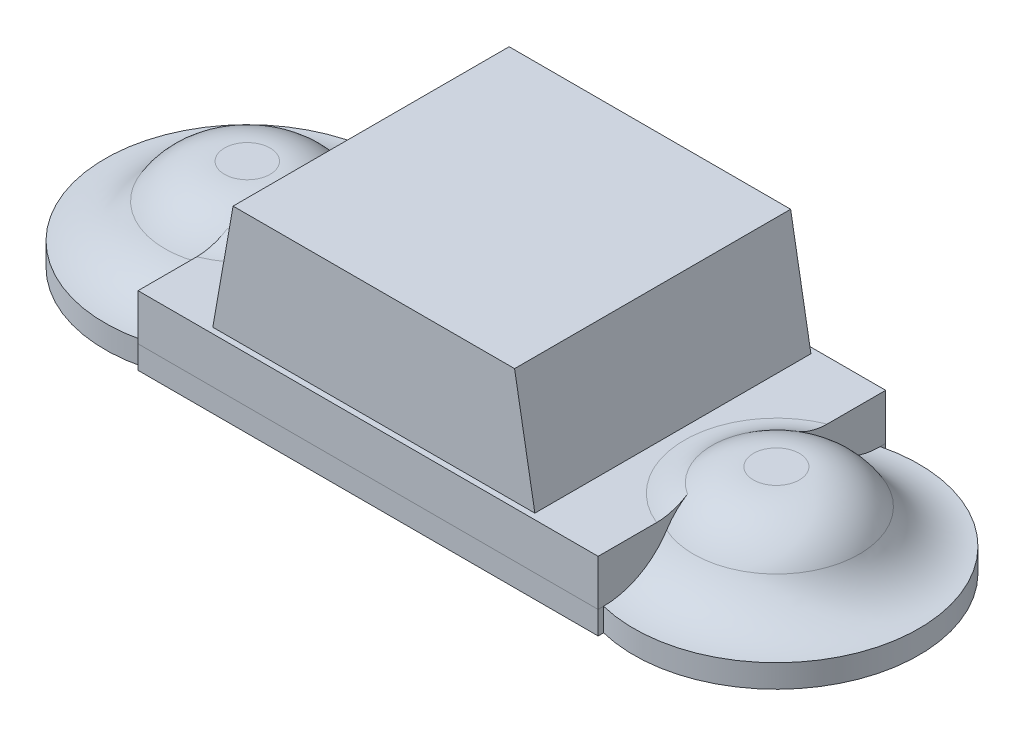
ISO-10303-21;
HEADER;
FILE_DESCRIPTION(('STEP AP214'),'2;1');
FILE_NAME('part.step','',(''),(''),'','','');
FILE_SCHEMA(('AUTOMOTIVE_DESIGN { 1 0 10303 214 1 1 1 1 }'));
ENDSEC;
DATA;
#1=APPLICATION_CONTEXT('core data for automotive mechanical design processes');
#2=APPLICATION_PROTOCOL_DEFINITION('international standard','automotive_design',2000,#1);
#3=PRODUCT_CONTEXT('',#1,'mechanical');
#4=PRODUCT('Part','Part','',(#3));
#5=PRODUCT_RELATED_PRODUCT_CATEGORY('part','',(#4));
#6=PRODUCT_DEFINITION_FORMATION('','',#4);
#7=PRODUCT_DEFINITION_CONTEXT('part definition',#1,'design');
#8=PRODUCT_DEFINITION('design','',#6,#7);
#9=PRODUCT_DEFINITION_SHAPE('','',#8);
#10=(LENGTH_UNIT() NAMED_UNIT(*) SI_UNIT(.MILLI.,.METRE.));
#11=(NAMED_UNIT(*) PLANE_ANGLE_UNIT() SI_UNIT($,.RADIAN.));
#12=(NAMED_UNIT(*) SI_UNIT($,.STERADIAN.) SOLID_ANGLE_UNIT());
#13=UNCERTAINTY_MEASURE_WITH_UNIT(LENGTH_MEASURE(1.E-05),#10,'distance_accuracy_value','');
#14=(GEOMETRIC_REPRESENTATION_CONTEXT(3) GLOBAL_UNCERTAINTY_ASSIGNED_CONTEXT((#13)) GLOBAL_UNIT_ASSIGNED_CONTEXT((#10,
#11,#12)) REPRESENTATION_CONTEXT('',''));
#15=CARTESIAN_POINT('',(0.,0.,0.));
#16=DIRECTION('',(0.,0.,1.));
#17=DIRECTION('',(1.,0.,0.));
#18=AXIS2_PLACEMENT_3D('',#15,#16,#17);
#19=CARTESIAN_POINT('',(-1.15,0.1,0.));
#20=DIRECTION('',(0.,-1.,0.));
#21=DIRECTION('',(0.,0.,-1.));
#22=AXIS2_PLACEMENT_3D('',#19,#20,#21);
#23=CYLINDRICAL_SURFACE('',#22,0.39913066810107);
#24=CARTESIAN_POINT('',(-1.15,0.,0.));
#25=DIRECTION('',(0.,1.,0.));
#26=DIRECTION('',(0.,0.,1.));
#27=AXIS2_PLACEMENT_3D('',#24,#25,#26);
#28=CIRCLE('',#27,0.39913066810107);
#29=CARTESIAN_POINT('',(-1.,0.,0.369871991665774));
#30=VERTEX_POINT('',#29);
#31=CARTESIAN_POINT('',(-1.,0.,-0.369871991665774));
#32=VERTEX_POINT('',#31);
#33=EDGE_CURVE('E141',#30,#32,#28,.T.);
#34=ORIENTED_EDGE('',*,*,#33,.F.);
#35=DIRECTION('',(0.,-1.,0.));
#36=VECTOR('',#35,1.);
#37=CARTESIAN_POINT('',(-1.,0.1,0.369871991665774));
#38=LINE('',#37,#36);
#39=CARTESIAN_POINT('',(-1.,0.1,0.369871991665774));
#40=VERTEX_POINT('',#39);
#41=EDGE_CURVE('E12',#40,#30,#38,.T.);
#42=ORIENTED_EDGE('',*,*,#41,.F.);
#43=CARTESIAN_POINT('',(-1.15,0.1,0.));
#44=DIRECTION('',(0.,1.,0.));
#45=DIRECTION('',(0.,0.,1.));
#46=AXIS2_PLACEMENT_3D('',#43,#44,#45);
#47=CIRCLE('',#46,0.39913066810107);
#48=CARTESIAN_POINT('',(-1.,0.1,-0.369871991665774));
#49=VERTEX_POINT('',#48);
#50=EDGE_CURVE('E161',#40,#49,#47,.T.);
#51=ORIENTED_EDGE('',*,*,#50,.T.);
#52=DIRECTION('',(0.,-1.,0.));
#53=VECTOR('',#52,1.);
#54=CARTESIAN_POINT('',(-1.,0.1,-0.369871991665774));
#55=LINE('',#54,#53);
#56=EDGE_CURVE('E47',#49,#32,#55,.T.);
#57=ORIENTED_EDGE('',*,*,#56,.T.);
#58=EDGE_LOOP('',(#34,#42,#51,#57));
#59=FACE_BOUND('',#58,.T.);
#60=ADVANCED_FACE('F44',(#59),#23,.F.);
#61=CARTESIAN_POINT('',(-1.,0.1,0.369871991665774));
#62=DIRECTION('',(-1.,0.,0.));
#63=DIRECTION('',(0.,0.,1.));
#64=AXIS2_PLACEMENT_3D('',#61,#62,#63);
#65=PLANE('',#64);
#66=DIRECTION('',(0.,0.,-1.));
#67=VECTOR('',#66,1.);
#68=CARTESIAN_POINT('',(-1.,0.,0.369871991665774));
#69=LINE('',#68,#67);
#70=CARTESIAN_POINT('',(-1.,0.,0.625));
#71=VERTEX_POINT('',#70);
#72=EDGE_CURVE('E159',#71,#30,#69,.T.);
#73=ORIENTED_EDGE('',*,*,#72,.F.);
#74=DIRECTION('',(0.,-1.,0.));
#75=VECTOR('',#74,1.);
#76=CARTESIAN_POINT('',(-1.,0.1,0.625));
#77=LINE('',#76,#75);
#78=CARTESIAN_POINT('',(-1.,0.1,0.625));
#79=VERTEX_POINT('',#78);
#80=EDGE_CURVE('E53',#79,#71,#77,.T.);
#81=ORIENTED_EDGE('',*,*,#80,.F.);
#82=DIRECTION('',(0.,0.,-1.));
#83=VECTOR('',#82,1.);
#84=CARTESIAN_POINT('',(-1.,0.1,0.369871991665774));
#85=LINE('',#84,#83);
#86=EDGE_CURVE('E131',#79,#40,#85,.T.);
#87=ORIENTED_EDGE('',*,*,#86,.T.);
#88=ORIENTED_EDGE('',*,*,#41,.T.);
#89=EDGE_LOOP('',(#73,#81,#87,#88));
#90=FACE_BOUND('',#89,.T.);
#91=ADVANCED_FACE('F173',(#90),#65,.T.);
#92=CARTESIAN_POINT('',(-1.,0.1,0.625));
#93=DIRECTION('',(0.,0.,1.));
#94=DIRECTION('',(1.,0.,0.));
#95=AXIS2_PLACEMENT_3D('',#92,#93,#94);
#96=PLANE('',#95);
#97=DIRECTION('',(-1.,0.,0.));
#98=VECTOR('',#97,1.);
#99=CARTESIAN_POINT('',(-1.,0.,0.625));
#100=LINE('',#99,#98);
#101=CARTESIAN_POINT('',(1.,0.,0.625));
#102=VERTEX_POINT('',#101);
#103=EDGE_CURVE('E118',#102,#71,#100,.T.);
#104=ORIENTED_EDGE('',*,*,#103,.F.);
#105=DIRECTION('',(0.,-1.,0.));
#106=VECTOR('',#105,1.);
#107=CARTESIAN_POINT('',(1.,0.1,0.625));
#108=LINE('',#107,#106);
#109=CARTESIAN_POINT('',(1.,0.1,0.625));
#110=VERTEX_POINT('',#109);
#111=EDGE_CURVE('E113',#110,#102,#108,.T.);
#112=ORIENTED_EDGE('',*,*,#111,.F.);
#113=DIRECTION('',(-1.,0.,0.));
#114=VECTOR('',#113,1.);
#115=CARTESIAN_POINT('',(-1.,0.1,0.625));
#116=LINE('',#115,#114);
#117=EDGE_CURVE('E116',#110,#79,#116,.T.);
#118=ORIENTED_EDGE('',*,*,#117,.T.);
#119=ORIENTED_EDGE('',*,*,#80,.T.);
#120=EDGE_LOOP('',(#104,#112,#118,#119));
#121=FACE_BOUND('',#120,.T.);
#122=ADVANCED_FACE('F115',(#121),#96,.T.);
#123=CARTESIAN_POINT('',(1.,0.1,0.625));
#124=DIRECTION('',(1.,0.,0.));
#125=DIRECTION('',(0.,0.,-1.));
#126=AXIS2_PLACEMENT_3D('',#123,#124,#125);
#127=PLANE('',#126);
#128=DIRECTION('',(0.,0.,1.));
#129=VECTOR('',#128,1.);
#130=CARTESIAN_POINT('',(1.,0.,0.625));
#131=LINE('',#130,#129);
#132=CARTESIAN_POINT('',(1.,0.,0.370809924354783));
#133=VERTEX_POINT('',#132);
#134=EDGE_CURVE('E156',#133,#102,#131,.T.);
#135=ORIENTED_EDGE('',*,*,#134,.F.);
#136=DIRECTION('',(0.,-1.,0.));
#137=VECTOR('',#136,1.);
#138=CARTESIAN_POINT('',(1.,0.1,0.370809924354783));
#139=LINE('',#138,#137);
#140=CARTESIAN_POINT('',(1.,0.1,0.370809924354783));
#141=VERTEX_POINT('',#140);
#142=EDGE_CURVE('E123',#141,#133,#139,.T.);
#143=ORIENTED_EDGE('',*,*,#142,.F.);
#144=DIRECTION('',(0.,0.,1.));
#145=VECTOR('',#144,1.);
#146=CARTESIAN_POINT('',(1.,0.1,0.625));
#147=LINE('',#146,#145);
#148=EDGE_CURVE('E129',#141,#110,#147,.T.);
#149=ORIENTED_EDGE('',*,*,#148,.T.);
#150=ORIENTED_EDGE('',*,*,#111,.T.);
#151=EDGE_LOOP('',(#135,#143,#149,#150));
#152=FACE_BOUND('',#151,.T.);
#153=ADVANCED_FACE('F133',(#152),#127,.T.);
#154=CARTESIAN_POINT('',(1.15,0.1,0.));
#155=DIRECTION('',(0.,-1.,0.));
#156=DIRECTION('',(0.,0.,-1.));
#157=AXIS2_PLACEMENT_3D('',#154,#155,#156);
#158=CYLINDRICAL_SURFACE('',#157,0.4);
#159=CARTESIAN_POINT('',(1.15,0.,0.));
#160=DIRECTION('',(0.,1.,0.));
#161=DIRECTION('',(0.,0.,1.));
#162=AXIS2_PLACEMENT_3D('',#159,#160,#161);
#163=CIRCLE('',#162,0.4);
#164=CARTESIAN_POINT('',(1.,0.,-0.370809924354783));
#165=VERTEX_POINT('',#164);
#166=EDGE_CURVE('E153',#165,#133,#163,.T.);
#167=ORIENTED_EDGE('',*,*,#166,.F.);
#168=DIRECTION('',(0.,-1.,0.));
#169=VECTOR('',#168,1.);
#170=CARTESIAN_POINT('',(1.,0.1,-0.370809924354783));
#171=LINE('',#170,#169);
#172=CARTESIAN_POINT('',(1.,0.1,-0.370809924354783));
#173=VERTEX_POINT('',#172);
#174=EDGE_CURVE('E165',#173,#165,#171,.T.);
#175=ORIENTED_EDGE('',*,*,#174,.F.);
#176=CARTESIAN_POINT('',(1.15,0.1,0.));
#177=DIRECTION('',(0.,1.,0.));
#178=DIRECTION('',(0.,0.,1.));
#179=AXIS2_PLACEMENT_3D('',#176,#177,#178);
#180=CIRCLE('',#179,0.4);
#181=EDGE_CURVE('E134',#173,#141,#180,.T.);
#182=ORIENTED_EDGE('',*,*,#181,.T.);
#183=ORIENTED_EDGE('',*,*,#142,.T.);
#184=EDGE_LOOP('',(#167,#175,#182,#183));
#185=FACE_BOUND('',#184,.T.);
#186=ADVANCED_FACE('F186',(#185),#158,.F.);
#187=CARTESIAN_POINT('',(1.,0.1,-0.370809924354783));
#188=DIRECTION('',(1.,0.,0.));
#189=DIRECTION('',(0.,0.,-1.));
#190=AXIS2_PLACEMENT_3D('',#187,#188,#189);
#191=PLANE('',#190);
#192=DIRECTION('',(0.,0.,1.));
#193=VECTOR('',#192,1.);
#194=CARTESIAN_POINT('',(1.,0.,-0.370809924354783));
#195=LINE('',#194,#193);
#196=CARTESIAN_POINT('',(1.,0.,-0.625));
#197=VERTEX_POINT('',#196);
#198=EDGE_CURVE('E150',#197,#165,#195,.T.);
#199=ORIENTED_EDGE('',*,*,#198,.F.);
#200=DIRECTION('',(0.,-1.,0.));
#201=VECTOR('',#200,1.);
#202=CARTESIAN_POINT('',(1.,0.1,-0.625));
#203=LINE('',#202,#201);
#204=CARTESIAN_POINT('',(1.,0.1,-0.625));
#205=VERTEX_POINT('',#204);
#206=EDGE_CURVE('E167',#205,#197,#203,.T.);
#207=ORIENTED_EDGE('',*,*,#206,.F.);
#208=DIRECTION('',(0.,0.,1.));
#209=VECTOR('',#208,1.);
#210=CARTESIAN_POINT('',(1.,0.1,-0.370809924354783));
#211=LINE('',#210,#209);
#212=EDGE_CURVE('E136',#205,#173,#211,.T.);
#213=ORIENTED_EDGE('',*,*,#212,.T.);
#214=ORIENTED_EDGE('',*,*,#174,.T.);
#215=EDGE_LOOP('',(#199,#207,#213,#214));
#216=FACE_BOUND('',#215,.T.);
#217=ADVANCED_FACE('F189',(#216),#191,.T.);
#218=CARTESIAN_POINT('',(1.,0.1,-0.625));
#219=DIRECTION('',(0.,0.,-1.));
#220=DIRECTION('',(-1.,0.,0.));
#221=AXIS2_PLACEMENT_3D('',#218,#219,#220);
#222=PLANE('',#221);
#223=DIRECTION('',(1.,0.,0.));
#224=VECTOR('',#223,1.);
#225=CARTESIAN_POINT('',(1.,0.,-0.625));
#226=LINE('',#225,#224);
#227=CARTESIAN_POINT('',(-1.,0.,-0.625));
#228=VERTEX_POINT('',#227);
#229=EDGE_CURVE('E147',#228,#197,#226,.T.);
#230=ORIENTED_EDGE('',*,*,#229,.F.);
#231=DIRECTION('',(0.,-1.,0.));
#232=VECTOR('',#231,1.);
#233=CARTESIAN_POINT('',(-1.,0.1,-0.625));
#234=LINE('',#233,#232);
#235=CARTESIAN_POINT('',(-1.,0.1,-0.625));
#236=VERTEX_POINT('',#235);
#237=EDGE_CURVE('E168',#236,#228,#234,.T.);
#238=ORIENTED_EDGE('',*,*,#237,.F.);
#239=DIRECTION('',(1.,0.,0.));
#240=VECTOR('',#239,1.);
#241=CARTESIAN_POINT('',(1.,0.1,-0.625));
#242=LINE('',#241,#240);
#243=EDGE_CURVE('E264',#236,#205,#242,.T.);
#244=ORIENTED_EDGE('',*,*,#243,.T.);
#245=ORIENTED_EDGE('',*,*,#206,.T.);
#246=EDGE_LOOP('',(#230,#238,#244,#245));
#247=FACE_BOUND('',#246,.T.);
#248=ADVANCED_FACE('F193',(#247),#222,.T.);
#249=CARTESIAN_POINT('',(-1.,0.1,-0.625));
#250=DIRECTION('',(-1.,0.,0.));
#251=DIRECTION('',(0.,0.,1.));
#252=AXIS2_PLACEMENT_3D('',#249,#250,#251);
#253=PLANE('',#252);
#254=DIRECTION('',(0.,0.,-1.));
#255=VECTOR('',#254,1.);
#256=CARTESIAN_POINT('',(-1.,0.,-0.625));
#257=LINE('',#256,#255);
#258=EDGE_CURVE('E144',#32,#228,#257,.T.);
#259=ORIENTED_EDGE('',*,*,#258,.F.);
#260=ORIENTED_EDGE('',*,*,#56,.F.);
#261=DIRECTION('',(0.,0.,-1.));
#262=VECTOR('',#261,1.);
#263=CARTESIAN_POINT('',(-1.,0.1,-0.625));
#264=LINE('',#263,#262);
#265=EDGE_CURVE('E265',#49,#236,#264,.T.);
#266=ORIENTED_EDGE('',*,*,#265,.T.);
#267=ORIENTED_EDGE('',*,*,#237,.T.);
#268=EDGE_LOOP('',(#259,#260,#266,#267));
#269=FACE_BOUND('',#268,.T.);
#270=ADVANCED_FACE('F170',(#269),#253,.T.);
#271=CARTESIAN_POINT('',(-1.15,0.1,0.));
#272=DIRECTION('',(0.,1.,0.));
#273=DIRECTION('',(0.,0.,1.));
#274=AXIS2_PLACEMENT_3D('',#271,#272,#273);
#275=PLANE('',#274);
#276=ORIENTED_EDGE('',*,*,#50,.F.);
#277=ORIENTED_EDGE('',*,*,#86,.F.);
#278=ORIENTED_EDGE('',*,*,#117,.F.);
#279=ORIENTED_EDGE('',*,*,#148,.F.);
#280=ORIENTED_EDGE('',*,*,#181,.F.);
#281=ORIENTED_EDGE('',*,*,#212,.F.);
#282=ORIENTED_EDGE('',*,*,#243,.F.);
#283=ORIENTED_EDGE('',*,*,#265,.F.);
#284=EDGE_LOOP('',(#276,#277,#278,#279,#280,#281,#282,#283));
#285=FACE_BOUND('',#284,.T.);
#286=ADVANCED_FACE('F127',(#285),#275,.T.);
#287=CARTESIAN_POINT('',(-1.15,0.,0.));
#288=DIRECTION('',(0.,1.,0.));
#289=DIRECTION('',(0.,0.,1.));
#290=AXIS2_PLACEMENT_3D('',#287,#288,#289);
#291=PLANE('',#290);
#292=ORIENTED_EDGE('',*,*,#33,.T.);
#293=ORIENTED_EDGE('',*,*,#258,.T.);
#294=ORIENTED_EDGE('',*,*,#229,.T.);
#295=ORIENTED_EDGE('',*,*,#198,.T.);
#296=ORIENTED_EDGE('',*,*,#166,.T.);
#297=ORIENTED_EDGE('',*,*,#134,.T.);
#298=ORIENTED_EDGE('',*,*,#103,.T.);
#299=ORIENTED_EDGE('',*,*,#72,.T.);
#300=EDGE_LOOP('',(#292,#293,#294,#295,#296,#297,#298,#299));
#301=FACE_BOUND('',#300,.T.);
#302=ADVANCED_FACE('F172',(#301),#291,.F.);
#303=CLOSED_SHELL('',(#60,#91,#122,#153,#186,#217,#248,#270,#286,#302));
#304=MANIFOLD_SOLID_BREP('B2',#303);
#305=CARTESIAN_POINT('',(0.,0.,0.));
#306=DIRECTION('',(0.,-1.,0.));
#307=DIRECTION('',(0.,0.,-1.));
#308=AXIS2_PLACEMENT_3D('',#305,#306,#307);
#309=PLANE('',#308);
#310=DIRECTION('',(0.,0.,1.));
#311=VECTOR('',#310,1.);
#312=CARTESIAN_POINT('',(1.,0.,0.625));
#313=LINE('',#312,#311);
#314=CARTESIAN_POINT('',(1.,0.,0.370809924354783));
#315=VERTEX_POINT('',#314);
#316=CARTESIAN_POINT('',(1.,0.,0.60118470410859));
#317=VERTEX_POINT('',#316);
#318=EDGE_CURVE('E454',#315,#317,#313,.T.);
#319=ORIENTED_EDGE('',*,*,#318,.F.);
#320=CARTESIAN_POINT('',(1.15,0.,0.));
#321=DIRECTION('',(0.,1.,0.));
#322=DIRECTION('',(0.,0.,1.));
#323=AXIS2_PLACEMENT_3D('',#320,#321,#322);
#324=CIRCLE('',#323,0.4);
#325=CARTESIAN_POINT('',(1.,0.,-0.370809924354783));
#326=VERTEX_POINT('',#325);
#327=EDGE_CURVE('E476',#326,#315,#324,.T.);
#328=ORIENTED_EDGE('',*,*,#327,.F.);
#329=DIRECTION('',(0.,0.,1.));
#330=VECTOR('',#329,1.);
#331=CARTESIAN_POINT('',(1.,0.,-0.370809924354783));
#332=LINE('',#331,#330);
#333=CARTESIAN_POINT('',(1.,0.,-0.60118470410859));
#334=VERTEX_POINT('',#333);
#335=EDGE_CURVE('E474',#334,#326,#332,.T.);
#336=ORIENTED_EDGE('',*,*,#335,.F.);
#337=CARTESIAN_POINT('',(1.15,0.,0.));
#338=DIRECTION('',(0.,-1.,0.));
#339=DIRECTION('',(0.,0.,-1.));
#340=AXIS2_PLACEMENT_3D('',#337,#338,#339);
#341=CIRCLE('',#340,0.619615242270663);
#342=EDGE_CURVE('E482',#334,#317,#341,.T.);
#343=ORIENTED_EDGE('',*,*,#342,.T.);
#344=EDGE_LOOP('',(#319,#328,#336,#343));
#345=FACE_BOUND('',#344,.T.);
#346=ADVANCED_FACE('F271',(#345),#309,.T.);
#347=CARTESIAN_POINT('',(1.,0.3,0.625));
#348=DIRECTION('',(-1.,0.,0.));
#349=DIRECTION('',(0.,0.,1.));
#350=AXIS2_PLACEMENT_3D('',#347,#348,#349);
#351=PLANE('',#350);
#352=DIRECTION('',(0.,-1.,0.));
#353=VECTOR('',#352,1.);
#354=CARTESIAN_POINT('',(1.,0.3,0.625));
#355=LINE('',#354,#353);
#356=CARTESIAN_POINT('',(1.,0.3,0.625));
#357=VERTEX_POINT('',#356);
#358=CARTESIAN_POINT('',(1.,0.1,0.625));
#359=VERTEX_POINT('',#358);
#360=EDGE_CURVE('E681',#357,#359,#355,.T.);
#361=ORIENTED_EDGE('',*,*,#360,.T.);
#362=DIRECTION('',(0.,0.,1.));
#363=VECTOR('',#362,1.);
#364=CARTESIAN_POINT('',(1.,0.1,0.625));
#365=LINE('',#364,#363);
#366=CARTESIAN_POINT('',(1.,0.1,0.60118470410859));
#367=VERTEX_POINT('',#366);
#368=EDGE_CURVE('E464',#367,#359,#365,.T.);
#369=ORIENTED_EDGE('',*,*,#368,.F.);
#370=CARTESIAN_POINT('',(1.,0.1,0.60118470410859));
#371=CARTESIAN_POINT('',(1.,0.0999862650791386,0.582874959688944));
#372=CARTESIAN_POINT('',(1.,0.101576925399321,0.564578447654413));
#373=CARTESIAN_POINT('',(1.,0.107806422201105,0.528534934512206));
#374=CARTESIAN_POINT('',(1.,0.11244121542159,0.510787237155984));
#375=CARTESIAN_POINT('',(1.,0.124598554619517,0.4763149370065));
#376=CARTESIAN_POINT('',(1.,0.132120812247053,0.459590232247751));
#377=CARTESIAN_POINT('',(1.,0.149819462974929,0.42761329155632));
#378=CARTESIAN_POINT('',(1.,0.15999548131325,0.412360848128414));
#379=CARTESIAN_POINT('',(1.,0.182398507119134,0.384179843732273));
#380=CARTESIAN_POINT('',(1.,0.194555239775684,0.371195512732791));
#381=CARTESIAN_POINT('',(1.,0.220857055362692,0.34739127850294));
#382=CARTESIAN_POINT('',(1.,0.235004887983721,0.3365744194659));
#383=CARTESIAN_POINT('',(1.,0.25,0.327049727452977));
#384=B_SPLINE_CURVE_WITH_KNOTS('',3,(#370,#371,#372,#373,#374,#375,#376,#377,#378,#379,#380,
#381,#382,#383),.UNSPECIFIED.,.F.,.F.,(4,2,2,2,2,2,4),(0.,0.0548411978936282,0.109609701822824,
0.164372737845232,0.219128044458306,0.272249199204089,0.325444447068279),.UNSPECIFIED.);
#385=CARTESIAN_POINT('',(1.,0.250000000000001,0.32704972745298));
#386=VERTEX_POINT('',#385);
#387=EDGE_CURVE('E622',#367,#386,#384,.T.);
#388=ORIENTED_EDGE('',*,*,#387,.T.);
#389=CARTESIAN_POINT('',(1.,0.395803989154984,0.));
#390=CARTESIAN_POINT('',(1.,0.395806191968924,-0.0127225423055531));
#391=CARTESIAN_POINT('',(1.,0.395540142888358,-0.0254472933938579));
#392=CARTESIAN_POINT('',(1.,0.394372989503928,-0.0508734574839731));
#393=CARTESIAN_POINT('',(1.,0.393471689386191,-0.0635748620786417));
#394=CARTESIAN_POINT('',(1.,0.390792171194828,-0.0888746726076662));
#395=CARTESIAN_POINT('',(1.,0.389015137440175,-0.101473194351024));
#396=CARTESIAN_POINT('',(1.,0.384355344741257,-0.126458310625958));
#397=CARTESIAN_POINT('',(1.,0.381473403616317,-0.138845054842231));
#398=CARTESIAN_POINT('',(1.,0.37302738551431,-0.168144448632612));
#399=CARTESIAN_POINT('',(1.,0.366851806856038,-0.184889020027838));
#400=CARTESIAN_POINT('',(1.,0.351820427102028,-0.217143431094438));
#401=CARTESIAN_POINT('',(1.,0.342964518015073,-0.232653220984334));
#402=CARTESIAN_POINT('',(1.,0.322605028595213,-0.261953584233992));
#403=CARTESIAN_POINT('',(1.,0.311088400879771,-0.27573515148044));
#404=CARTESIAN_POINT('',(1.,0.285714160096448,-0.300952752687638));
#405=CARTESIAN_POINT('',(1.,0.271856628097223,-0.312388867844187));
#406=CARTESIAN_POINT('',(1.,0.243448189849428,-0.331641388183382));
#407=CARTESIAN_POINT('',(1.,0.229044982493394,-0.33967632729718));
#408=CARTESIAN_POINT('',(1.,0.199058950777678,-0.35310666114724));
#409=CARTESIAN_POINT('',(1.,0.183476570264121,-0.35850304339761));
#410=CARTESIAN_POINT('',(1.,0.152194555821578,-0.36632643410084));
#411=CARTESIAN_POINT('',(1.,0.136520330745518,-0.368855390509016));
#412=CARTESIAN_POINT('',(1.,0.104969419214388,-0.371214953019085));
#413=CARTESIAN_POINT('',(1.,0.0890927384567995,-0.371045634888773));
#414=CARTESIAN_POINT('',(1.,0.0577675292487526,-0.368030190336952));
#415=CARTESIAN_POINT('',(1.,0.042316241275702,-0.36521260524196));
#416=CARTESIAN_POINT('',(1.,0.0121067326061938,-0.357031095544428));
#417=CARTESIAN_POINT('',(1.,-0.00265160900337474,-0.351667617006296));
#418=CARTESIAN_POINT('',(1.,-0.0311112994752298,-0.338542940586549));
#419=CARTESIAN_POINT('',(1.,-0.0448094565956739,-0.330774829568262));
#420=CARTESIAN_POINT('',(1.,-0.0707428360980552,-0.313084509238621));
#421=CARTESIAN_POINT('',(1.,-0.0829773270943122,-0.303161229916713));
#422=CARTESIAN_POINT('',(1.,-0.105893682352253,-0.281260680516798));
#423=CARTESIAN_POINT('',(1.,-0.116541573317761,-0.26924791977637));
#424=CARTESIAN_POINT('',(1.,-0.135765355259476,-0.243695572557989));
#425=CARTESIAN_POINT('',(1.,-0.144343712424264,-0.230157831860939));
#426=CARTESIAN_POINT('',(1.,-0.15972736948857,-0.201223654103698));
#427=CARTESIAN_POINT('',(1.,-0.166419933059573,-0.185767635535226));
#428=CARTESIAN_POINT('',(1.,-0.177501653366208,-0.154026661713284));
#429=CARTESIAN_POINT('',(1.,-0.181885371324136,-0.13773984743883));
#430=CARTESIAN_POINT('',(1.,-0.188604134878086,-0.10491909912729));
#431=CARTESIAN_POINT('',(1.,-0.19095689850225,-0.088388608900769));
#432=CARTESIAN_POINT('',(1.,-0.194212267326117,-0.0551678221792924));
#433=CARTESIAN_POINT('',(1.,-0.195111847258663,-0.0384772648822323));
#434=CARTESIAN_POINT('',(1.,-0.195957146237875,-0.00502766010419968));
#435=CARTESIAN_POINT('',(1.,-0.195899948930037,0.0117314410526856));
#436=CARTESIAN_POINT('',(1.,-0.194777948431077,0.0452031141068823));
#437=CARTESIAN_POINT('',(1.,-0.193714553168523,0.0619157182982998));
#438=CARTESIAN_POINT('',(1.,-0.190805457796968,0.0883044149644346));
#439=CARTESIAN_POINT('',(1.,-0.189464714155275,0.0980339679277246));
#440=CARTESIAN_POINT('',(1.,-0.186145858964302,0.117382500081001));
#441=CARTESIAN_POINT('',(1.,-0.184167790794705,0.127001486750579));
#442=CARTESIAN_POINT('',(1.,-0.177163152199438,0.155500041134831));
#443=CARTESIAN_POINT('',(1.,-0.171055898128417,0.174135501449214));
#444=CARTESIAN_POINT('',(1.,-0.155518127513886,0.210265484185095));
#445=CARTESIAN_POINT('',(1.,-0.146046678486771,0.227742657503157));
#446=CARTESIAN_POINT('',(1.,-0.123842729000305,0.260564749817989));
#447=CARTESIAN_POINT('',(1.,-0.111103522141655,0.275905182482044));
#448=CARTESIAN_POINT('',(1.,-0.0846250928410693,0.301855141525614));
#449=CARTESIAN_POINT('',(1.,-0.0712334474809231,0.312820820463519));
#450=CARTESIAN_POINT('',(1.,-0.0426986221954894,0.332139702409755));
#451=CARTESIAN_POINT('',(1.,-0.0275576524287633,0.340496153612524));
#452=CARTESIAN_POINT('',(1.,0.00290584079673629,0.353820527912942));
#453=CARTESIAN_POINT('',(1.,0.0181439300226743,0.358982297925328));
#454=CARTESIAN_POINT('',(1.,0.0492823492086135,0.36661559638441));
#455=CARTESIAN_POINT('',(1.,0.0651826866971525,0.369087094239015));
#456=CARTESIAN_POINT('',(1.,0.0968403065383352,0.371234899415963));
#457=CARTESIAN_POINT('',(1.,0.112593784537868,0.37096775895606));
#458=CARTESIAN_POINT('',(1.,0.143829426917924,0.367783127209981));
#459=CARTESIAN_POINT('',(1.,0.159311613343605,0.364865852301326));
#460=CARTESIAN_POINT('',(1.,0.189518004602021,0.356486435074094));
#461=CARTESIAN_POINT('',(1.,0.204244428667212,0.351032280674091));
#462=CARTESIAN_POINT('',(1.,0.232584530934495,0.337752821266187));
#463=CARTESIAN_POINT('',(1.,0.246198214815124,0.32992752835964));
#464=CARTESIAN_POINT('',(1.,0.272085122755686,0.312057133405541));
#465=CARTESIAN_POINT('',(1.,0.284343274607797,0.301990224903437));
#466=CARTESIAN_POINT('',(1.,0.307056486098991,0.279997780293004));
#467=CARTESIAN_POINT('',(1.,0.317511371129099,0.268072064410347));
#468=CARTESIAN_POINT('',(1.,0.336705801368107,0.242318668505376));
#469=CARTESIAN_POINT('',(1.,0.34538011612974,0.228442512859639));
#470=CARTESIAN_POINT('',(1.,0.360482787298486,0.199532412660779));
#471=CARTESIAN_POINT('',(1.,0.366911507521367,0.184498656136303));
#472=CARTESIAN_POINT('',(1.,0.380128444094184,0.146288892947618));
#473=CARTESIAN_POINT('',(1.,0.385611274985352,0.12266488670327));
#474=CARTESIAN_POINT('',(1.,0.392880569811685,0.0748964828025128));
#475=CARTESIAN_POINT('',(1.,0.394658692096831,0.0507510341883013));
#476=CARTESIAN_POINT('',(1.,0.395670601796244,0.0177339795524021));
#477=CARTESIAN_POINT('',(1.,0.395802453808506,0.00886752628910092));
#478=CARTESIAN_POINT('',(1.,0.395803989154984,0.));
#479=B_SPLINE_CURVE_WITH_KNOTS('',3,(#389,#390,#391,#392,#393,#394,#395,#396,#397,#398,#399,
#400,#401,#402,#403,#404,#405,#406,#407,#408,#409,#410,#411,#412,#413,#414,#415,#416,#417,#418,
#419,#420,#421,#422,#423,#424,#425,#426,#427,#428,#429,#430,#431,#432,#433,#434,#435,#436,#437,
#438,#439,#440,#441,#442,#443,#444,#445,#446,#447,#448,#449,#450,#451,#452,#453,#454,#455,#456,
#457,#458,#459,#460,#461,#462,#463,#464,#465,#466,#467,#468,#469,#470,#471,#472,#473,#474,#475,
#476,#477,#478),.UNSPECIFIED.,.T.,.F.,(4,2,2,2,2,2,2,2,2,2,2,2,2,2,2,2,2,2,2,2,2,2,2,2,2,2,2,2,
2,2,2,2,2,2,2,2,2,2,2,2,2,2,2,2,4),(0.,0.038167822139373,0.0763474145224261,0.114475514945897,
0.152575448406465,0.205890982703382,0.259208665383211,0.312793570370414,0.366376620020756,
0.415608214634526,0.464821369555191,0.512223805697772,0.55962491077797,0.60652094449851,
0.653408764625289,0.700432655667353,0.747479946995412,0.795422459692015,0.843307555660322,
0.893634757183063,0.944079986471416,0.994080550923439,1.04418507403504,1.09444234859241,
1.144629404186,1.17407463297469,1.20351785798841,1.26206320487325,1.32134675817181,
1.38075296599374,1.43240497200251,1.48399241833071,1.53202440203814,1.5800569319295,
1.6270996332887,1.67413849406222,1.72103023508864,1.76792173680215,1.81529104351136,
1.86266493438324,1.91154750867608,1.96042215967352,2.03272943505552,2.10519934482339,
2.13180205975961),.UNSPECIFIED.);
#480=CARTESIAN_POINT('',(1.00000000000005,0.34,0.236431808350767));
#481=VERTEX_POINT('',#480);
#482=EDGE_CURVE('E499',#386,#481,#479,.T.);
#483=ORIENTED_EDGE('',*,*,#482,.T.);
#484=CARTESIAN_POINT('',(1.00000000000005,0.34,0.236431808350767));
#485=CARTESIAN_POINT('',(1.00000000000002,0.330716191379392,0.251050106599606));
#486=CARTESIAN_POINT('',(1.,0.322855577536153,0.266637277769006));
#487=CARTESIAN_POINT('',(0.999999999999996,0.310575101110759,0.298598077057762));
#488=CARTESIAN_POINT('',(0.999999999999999,0.306063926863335,0.314936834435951));
#489=CARTESIAN_POINT('',(1.,0.302205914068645,0.337996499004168));
#490=CARTESIAN_POINT('',(1.,0.301388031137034,0.344486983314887));
#491=CARTESIAN_POINT('',(1.,0.300282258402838,0.357586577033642));
#492=CARTESIAN_POINT('',(1.,0.300000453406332,0.364196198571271));
#493=CARTESIAN_POINT('',(1.,0.299999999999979,0.37080992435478));
#494=B_SPLINE_CURVE_WITH_KNOTS('',3,(#484,#485,#486,#487,#488,#489,#490,#491,#492,#493),
.UNSPECIFIED.,.F.,.F.,(4,2,2,2,4),(0.,0.0519685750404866,0.102462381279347,0.122068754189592,
0.141896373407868),.UNSPECIFIED.);
#495=CARTESIAN_POINT('',(1.,0.3,0.370809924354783));
#496=VERTEX_POINT('',#495);
#497=EDGE_CURVE('E638',#481,#496,#494,.T.);
#498=ORIENTED_EDGE('',*,*,#497,.T.);
#499=DIRECTION('',(0.,0.,-1.));
#500=VECTOR('',#499,1.);
#501=CARTESIAN_POINT('',(1.,0.3,0.625));
#502=LINE('',#501,#500);
#503=EDGE_CURVE('E692',#357,#496,#502,.T.);
#504=ORIENTED_EDGE('',*,*,#503,.F.);
#505=EDGE_LOOP('',(#361,#369,#388,#483,#498,#504));
#506=FACE_BOUND('',#505,.T.);
#507=ADVANCED_FACE('F533',(#506),#351,.F.);
#508=CARTESIAN_POINT('',(1.,0.25,-0.327049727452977));
#509=CARTESIAN_POINT('',(1.,0.234662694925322,-0.336791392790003));
#510=CARTESIAN_POINT('',(1.,0.220211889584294,-0.347885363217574));
#511=CARTESIAN_POINT('',(1.,0.193405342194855,-0.372332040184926));
#512=CARTESIAN_POINT('',(1.,0.181046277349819,-0.385681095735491));
#513=CARTESIAN_POINT('',(1.,0.158702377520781,-0.414215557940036));
#514=CARTESIAN_POINT('',(1.,0.148715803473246,-0.429399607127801));
#515=CARTESIAN_POINT('',(1.,0.131358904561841,-0.4611980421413));
#516=CARTESIAN_POINT('',(1.,0.123988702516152,-0.477812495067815));
#517=CARTESIAN_POINT('',(1.,0.11211653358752,-0.511957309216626));
#518=CARTESIAN_POINT('',(1.,0.107602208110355,-0.529483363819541));
#519=CARTESIAN_POINT('',(1.,0.101535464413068,-0.565063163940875));
#520=CARTESIAN_POINT('',(1.,0.0999870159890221,-0.583117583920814));
#521=CARTESIAN_POINT('',(1.,0.1,-0.60118470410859));
#522=B_SPLINE_CURVE_WITH_KNOTS('',3,(#508,#509,#510,#511,#512,#513,#514,#515,#516,#517,#518,
#519,#520,#521),.UNSPECIFIED.,.F.,.F.,(4,2,2,2,2,2,4),(0.,0.0544056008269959,0.108723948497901,
0.163002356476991,0.217283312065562,0.271327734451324,0.325444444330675),.UNSPECIFIED.);
#523=CARTESIAN_POINT('',(1.,0.250000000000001,-0.327049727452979));
#524=VERTEX_POINT('',#523);
#525=CARTESIAN_POINT('',(1.,0.1,-0.60118470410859));
#526=VERTEX_POINT('',#525);
#527=EDGE_CURVE('E568',#524,#526,#522,.T.);
#528=ORIENTED_EDGE('',*,*,#527,.T.);
#529=DIRECTION('',(0.,0.,1.));
#530=VECTOR('',#529,1.);
#531=CARTESIAN_POINT('',(1.,0.1,-0.370809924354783));
#532=LINE('',#531,#530);
#533=CARTESIAN_POINT('',(1.,0.1,-0.625));
#534=VERTEX_POINT('',#533);
#535=EDGE_CURVE('E459',#534,#526,#532,.T.);
#536=ORIENTED_EDGE('',*,*,#535,.F.);
#537=DIRECTION('',(0.,-1.,0.));
#538=VECTOR('',#537,1.);
#539=CARTESIAN_POINT('',(1.,0.3,-0.625));
#540=LINE('',#539,#538);
#541=CARTESIAN_POINT('',(1.,0.3,-0.625));
#542=VERTEX_POINT('',#541);
#543=EDGE_CURVE('E684',#542,#534,#540,.T.);
#544=ORIENTED_EDGE('',*,*,#543,.F.);
#545=CARTESIAN_POINT('',(1.,0.3,-0.370809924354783));
#546=VERTEX_POINT('',#545);
#547=EDGE_CURVE('E694',#546,#542,#502,.T.);
#548=ORIENTED_EDGE('',*,*,#547,.F.);
#549=CARTESIAN_POINT('',(1.,0.3,-0.370809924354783));
#550=CARTESIAN_POINT('',(1.,0.29998900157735,-0.356756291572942));
#551=CARTESIAN_POINT('',(1.,0.301271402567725,-0.342723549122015));
#552=CARTESIAN_POINT('',(1.,0.306157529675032,-0.315390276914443));
#553=CARTESIAN_POINT('',(1.,0.309708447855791,-0.302080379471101));
#554=CARTESIAN_POINT('',(1.,0.317547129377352,-0.279989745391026));
#555=CARTESIAN_POINT('',(1.,0.321317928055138,-0.271020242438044));
#556=CARTESIAN_POINT('',(1.,0.329895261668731,-0.253409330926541));
#557=CARTESIAN_POINT('',(1.,0.334717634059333,-0.244775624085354));
#558=CARTESIAN_POINT('',(1.,0.34,-0.236431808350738));
#559=B_SPLINE_CURVE_WITH_KNOTS('',3,(#549,#550,#551,#552,#553,#554,#555,#556,#557,#558),
.UNSPECIFIED.,.F.,.F.,(4,2,2,2,4),(0.,0.0420750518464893,0.0832046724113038,0.112338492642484,
0.141945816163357),.UNSPECIFIED.);
#560=CARTESIAN_POINT('',(1.,0.34,-0.236431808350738));
#561=VERTEX_POINT('',#560);
#562=EDGE_CURVE('E645',#546,#561,#559,.T.);
#563=ORIENTED_EDGE('',*,*,#562,.T.);
#564=EDGE_CURVE('E508',#561,#524,#479,.T.);
#565=ORIENTED_EDGE('',*,*,#564,.T.);
#566=EDGE_LOOP('',(#528,#536,#544,#548,#563,#565));
#567=FACE_BOUND('',#566,.T.);
#568=ADVANCED_FACE('F540',(#567),#351,.F.);
#569=CARTESIAN_POINT('',(-1.,0.3,0.625));
#570=DIRECTION('',(1.,0.,0.));
#571=DIRECTION('',(0.,0.,-1.));
#572=AXIS2_PLACEMENT_3D('',#569,#570,#571);
#573=PLANE('',#572);
#574=CARTESIAN_POINT('',(-1.,0.25,0.326093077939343));
#575=CARTESIAN_POINT('',(-1.,0.234658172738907,0.335842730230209));
#576=CARTESIAN_POINT('',(-1.,0.220203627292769,0.346945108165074));
#577=CARTESIAN_POINT('',(-1.,0.193390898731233,0.371409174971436));
#578=CARTESIAN_POINT('',(-1.,0.18102940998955,0.384767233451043));
#579=CARTESIAN_POINT('',(-1.,0.158682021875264,0.413319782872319));
#580=CARTESIAN_POINT('',(-1.,0.148694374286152,0.428512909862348));
#581=CARTESIAN_POINT('',(-1.,0.131336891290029,0.460329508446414));
#582=CARTESIAN_POINT('',(-1.,0.123967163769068,0.476953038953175));
#583=CARTESIAN_POINT('',(-1.,0.112103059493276,0.511100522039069));
#584=CARTESIAN_POINT('',(-1.,0.107593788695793,0.528619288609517));
#585=CARTESIAN_POINT('',(-1.,0.101533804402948,0.564183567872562));
#586=CARTESIAN_POINT('',(-1.,0.0999870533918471,0.582229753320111));
#587=CARTESIAN_POINT('',(-1.,0.1,0.600288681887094));
#588=B_SPLINE_CURVE_WITH_KNOTS('',3,(#574,#575,#576,#577,#578,#579,#580,#581,#582,#583,#584,
#585,#586,#587),.UNSPECIFIED.,.F.,.F.,(4,2,2,2,2,2,4),(0.,0.054429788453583,0.108772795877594,
0.163075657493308,0.217380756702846,0.271400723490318,0.325492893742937),.UNSPECIFIED.);
#589=CARTESIAN_POINT('',(-1.,0.250000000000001,0.326093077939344));
#590=VERTEX_POINT('',#589);
#591=CARTESIAN_POINT('',(-1.,0.1,0.600288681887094));
#592=VERTEX_POINT('',#591);
#593=EDGE_CURVE('E42',#590,#592,#588,.T.);
#594=ORIENTED_EDGE('',*,*,#593,.T.);
#595=DIRECTION('',(0.,0.,-1.));
#596=VECTOR('',#595,1.);
#597=CARTESIAN_POINT('',(-1.,0.1,0.369871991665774));
#598=LINE('',#597,#596);
#599=CARTESIAN_POINT('',(-1.,0.1,0.625));
#600=VERTEX_POINT('',#599);
#601=EDGE_CURVE('E437',#600,#592,#598,.T.);
#602=ORIENTED_EDGE('',*,*,#601,.F.);
#603=DIRECTION('',(0.,-1.,0.));
#604=VECTOR('',#603,1.);
#605=CARTESIAN_POINT('',(-1.,0.3,0.625));
#606=LINE('',#605,#604);
#607=CARTESIAN_POINT('',(-1.,0.3,0.625));
#608=VERTEX_POINT('',#607);
#609=EDGE_CURVE('E678',#608,#600,#606,.T.);
#610=ORIENTED_EDGE('',*,*,#609,.F.);
#611=DIRECTION('',(0.,0.,1.));
#612=VECTOR('',#611,1.);
#613=CARTESIAN_POINT('',(-1.,0.3,0.625));
#614=LINE('',#613,#612);
#615=CARTESIAN_POINT('',(-1.,0.3,0.369871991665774));
#616=VERTEX_POINT('',#615);
#617=EDGE_CURVE('E700',#616,#608,#614,.T.);
#618=ORIENTED_EDGE('',*,*,#617,.F.);
#619=CARTESIAN_POINT('',(-1.,0.3,0.369871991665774));
#620=CARTESIAN_POINT('',(-1.,0.299988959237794,0.355802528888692));
#621=CARTESIAN_POINT('',(-1.,0.301273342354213,0.341754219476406));
#622=CARTESIAN_POINT('',(-1.,0.306165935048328,0.314390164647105));
#623=CARTESIAN_POINT('',(-1.,0.309721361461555,0.30106505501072));
#624=CARTESIAN_POINT('',(-1.,0.317564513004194,0.278960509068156));
#625=CARTESIAN_POINT('',(-1.,0.321333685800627,0.26999170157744));
#626=CARTESIAN_POINT('',(-1.,0.329905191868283,0.252381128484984));
#627=CARTESIAN_POINT('',(-1.,0.334723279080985,0.243747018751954));
#628=CARTESIAN_POINT('',(-1.,0.34,0.235401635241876));
#629=B_SPLINE_CURVE_WITH_KNOTS('',3,(#619,#620,#621,#622,#623,#624,#625,#626,#627,#628),
.UNSPECIFIED.,.F.,.F.,(4,2,2,2,4),(0.,0.0421220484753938,0.0832990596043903,0.112429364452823,
0.142031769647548),.UNSPECIFIED.);
#630=CARTESIAN_POINT('',(-1.,0.34,0.235401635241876));
#631=VERTEX_POINT('',#630);
#632=EDGE_CURVE('E597',#616,#631,#629,.T.);
#633=ORIENTED_EDGE('',*,*,#632,.T.);
#634=CARTESIAN_POINT('',(-1.,0.395655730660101,0.));
#635=CARTESIAN_POINT('',(-1.,0.395658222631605,0.0127280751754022));
#636=CARTESIAN_POINT('',(-1.,0.395386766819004,0.0254584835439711));
#637=CARTESIAN_POINT('',(-1.,0.394199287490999,0.0508951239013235));
#638=CARTESIAN_POINT('',(-1.,0.393283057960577,0.063601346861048));
#639=CARTESIAN_POINT('',(-1.,0.39056528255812,0.0889092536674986));
#640=CARTESIAN_POINT('',(-1.,0.388764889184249,0.101511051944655));
#641=CARTESIAN_POINT('',(-1.,0.384051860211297,0.126499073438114));
#642=CARTESIAN_POINT('',(-1.,0.381140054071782,0.138885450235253));
#643=CARTESIAN_POINT('',(-1.,0.372628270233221,0.168138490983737));
#644=CARTESIAN_POINT('',(-1.,0.366420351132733,0.184836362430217));
#645=CARTESIAN_POINT('',(-1.,0.351332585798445,0.21699222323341));
#646=CARTESIAN_POINT('',(-1.,0.342452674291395,0.232450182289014));
#647=CARTESIAN_POINT('',(-1.,0.322056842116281,0.261643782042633));
#648=CARTESIAN_POINT('',(-1.,0.310528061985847,0.275370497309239));
#649=CARTESIAN_POINT('',(-1.,0.285142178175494,0.300479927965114));
#650=CARTESIAN_POINT('',(-1.,0.271285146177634,0.311862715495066));
#651=CARTESIAN_POINT('',(-1.,0.242874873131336,0.331027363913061));
#652=CARTESIAN_POINT('',(-1.,0.228466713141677,0.339024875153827));
#653=CARTESIAN_POINT('',(-1.,0.198477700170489,0.352381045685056));
#654=CARTESIAN_POINT('',(-1.,0.182897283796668,0.357740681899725));
#655=CARTESIAN_POINT('',(-1.,0.151620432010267,0.365495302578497));
#656=CARTESIAN_POINT('',(-1.,0.135948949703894,0.367991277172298));
#657=CARTESIAN_POINT('',(-1.,0.104409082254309,0.370286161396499));
#658=CARTESIAN_POINT('',(-1.,0.0885407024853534,0.3700851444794));
#659=CARTESIAN_POINT('',(-1.,0.0572352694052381,0.367008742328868));
#660=CARTESIAN_POINT('',(-1.,0.0417954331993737,0.36416155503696));
#661=CARTESIAN_POINT('',(-1.,0.0116135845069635,0.355923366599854));
#662=CARTESIAN_POINT('',(-1.,-0.00312855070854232,0.350532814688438));
#663=CARTESIAN_POINT('',(-1.,-0.031552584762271,0.337356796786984));
#664=CARTESIAN_POINT('',(-1.,-0.0452312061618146,0.3295642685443));
#665=CARTESIAN_POINT('',(-1.,-0.071121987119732,0.311828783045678));
#666=CARTESIAN_POINT('',(-1.,-0.0833334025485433,0.301884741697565));
#667=CARTESIAN_POINT('',(-1.,-0.106201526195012,0.279945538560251));
#668=CARTESIAN_POINT('',(-1.,-0.116824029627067,0.267914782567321));
#669=CARTESIAN_POINT('',(-1.,-0.135994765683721,0.242331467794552));
#670=CARTESIAN_POINT('',(-1.,-0.144545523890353,0.228780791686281));
#671=CARTESIAN_POINT('',(-1.,-0.159874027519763,0.19982180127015));
#672=CARTESIAN_POINT('',(-1.,-0.166538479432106,0.184353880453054));
#673=CARTESIAN_POINT('',(-1.,-0.177565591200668,0.15259256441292));
#674=CARTESIAN_POINT('',(-1.,-0.181922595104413,0.13629724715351));
#675=CARTESIAN_POINT('',(-1.,-0.188592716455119,0.103460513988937));
#676=CARTESIAN_POINT('',(-1.,-0.190923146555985,0.0869224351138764));
#677=CARTESIAN_POINT('',(-1.,-0.194137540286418,0.0536884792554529));
#678=CARTESIAN_POINT('',(-1.,-0.195018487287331,0.0369923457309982));
#679=CARTESIAN_POINT('',(-1.,-0.195817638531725,0.00353546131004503));
#680=CARTESIAN_POINT('',(-1.,-0.195733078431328,-0.0132253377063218));
#681=CARTESIAN_POINT('',(-1.,-0.194528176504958,-0.0466967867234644));
#682=CARTESIAN_POINT('',(-1.,-0.193409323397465,-0.0634074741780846));
#683=CARTESIAN_POINT('',(-1.,-0.190393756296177,-0.0897386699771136));
#684=CARTESIAN_POINT('',(-1.,-0.189014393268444,-0.0994162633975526));
#685=CARTESIAN_POINT('',(-1.,-0.185616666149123,-0.118657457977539));
#686=CARTESIAN_POINT('',(-1.,-0.183598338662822,-0.128221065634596));
#687=CARTESIAN_POINT('',(-1.,-0.176475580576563,-0.156549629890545));
#688=CARTESIAN_POINT('',(-1.,-0.170292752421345,-0.17506475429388));
#689=CARTESIAN_POINT('',(-1.,-0.154631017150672,-0.210936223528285));
#690=CARTESIAN_POINT('',(-1.,-0.145112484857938,-0.228275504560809));
#691=CARTESIAN_POINT('',(-1.,-0.12285169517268,-0.260821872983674));
#692=CARTESIAN_POINT('',(-1.,-0.110102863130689,-0.276024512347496));
#693=CARTESIAN_POINT('',(-1.,-0.0836077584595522,-0.301762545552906));
#694=CARTESIAN_POINT('',(-1.,-0.0701985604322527,-0.312646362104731));
#695=CARTESIAN_POINT('',(-1.,-0.0416458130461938,-0.331803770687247));
#696=CARTESIAN_POINT('',(-1.,-0.0265044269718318,-0.34008057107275));
#697=CARTESIAN_POINT('',(-1.,0.00396450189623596,-0.353265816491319));
#698=CARTESIAN_POINT('',(-1.,0.019210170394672,-0.358364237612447));
#699=CARTESIAN_POINT('',(-1.,0.0503526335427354,-0.365871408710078));
#700=CARTESIAN_POINT('',(-1.,0.0662494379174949,-0.368280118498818));
#701=CARTESIAN_POINT('',(-1.,0.0978946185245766,-0.370306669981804));
#702=CARTESIAN_POINT('',(-1.,0.113639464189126,-0.369980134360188));
#703=CARTESIAN_POINT('',(-1.,0.144848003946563,-0.366679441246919));
#704=CARTESIAN_POINT('',(-1.,0.160311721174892,-0.363705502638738));
#705=CARTESIAN_POINT('',(-1.,0.190474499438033,-0.355216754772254));
#706=CARTESIAN_POINT('',(-1.,0.205175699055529,-0.349709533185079));
#707=CARTESIAN_POINT('',(-1.,0.233457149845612,-0.336329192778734));
#708=CARTESIAN_POINT('',(-1.,0.247037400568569,-0.328456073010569));
#709=CARTESIAN_POINT('',(-1.,0.272852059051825,-0.310494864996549));
#710=CARTESIAN_POINT('',(-1.,0.285071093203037,-0.30038470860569));
#711=CARTESIAN_POINT('',(-1.,0.307699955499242,-0.278313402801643));
#712=CARTESIAN_POINT('',(-1.,0.318109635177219,-0.266352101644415));
#713=CARTESIAN_POINT('',(-1.,0.33721125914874,-0.240531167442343));
#714=CARTESIAN_POINT('',(-1.,0.345837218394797,-0.22662286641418));
#715=CARTESIAN_POINT('',(-1.,0.360841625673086,-0.197656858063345));
#716=CARTESIAN_POINT('',(-1.,0.367220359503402,-0.182599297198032));
#717=CARTESIAN_POINT('',(-1.,0.380353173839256,-0.144230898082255));
#718=CARTESIAN_POINT('',(-1.,0.385779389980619,-0.120469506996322));
#719=CARTESIAN_POINT('',(-1.,0.392931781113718,-0.0724392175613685));
#720=CARTESIAN_POINT('',(-1.,0.394649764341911,-0.04816931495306));
#721=CARTESIAN_POINT('',(-1.,0.395545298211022,-0.0159316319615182));
#722=CARTESIAN_POINT('',(-1.,0.395654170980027,-0.00796627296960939));
#723=CARTESIAN_POINT('',(-1.,0.395655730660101,0.));
#724=B_SPLINE_CURVE_WITH_KNOTS('',3,(#634,#635,#636,#637,#638,#639,#640,#641,#642,#643,#644,
#645,#646,#647,#648,#649,#650,#651,#652,#653,#654,#655,#656,#657,#658,#659,#660,#661,#662,#663,
#664,#665,#666,#667,#668,#669,#670,#671,#672,#673,#674,#675,#676,#677,#678,#679,#680,#681,#682,
#683,#684,#685,#686,#687,#688,#689,#690,#691,#692,#693,#694,#695,#696,#697,#698,#699,#700,#701,
#702,#703,#704,#705,#706,#707,#708,#709,#710,#711,#712,#713,#714,#715,#716,#717,#718,#719,#720,
#721,#722,#723),.UNSPECIFIED.,.T.,.F.,(4,2,2,2,2,2,2,2,2,2,2,2,2,2,2,2,2,2,2,2,2,2,2,2,2,2,2,2,
2,2,2,2,2,2,2,2,2,2,2,2,2,2,2,2,4),(0.,0.0381845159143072,0.0763812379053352,0.114528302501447,
0.152646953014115,0.20586490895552,0.259084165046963,0.312567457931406,0.366049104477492,
0.415239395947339,0.464411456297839,0.511790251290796,0.559167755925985,0.606046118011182,
0.652916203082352,0.699925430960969,0.746958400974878,0.79489098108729,0.842764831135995,
0.893091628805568,0.943541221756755,0.993555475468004,1.04367368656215,1.09393542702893,
1.14412493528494,1.17343159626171,1.20273657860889,1.26101091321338,1.32000237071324,
1.37911487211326,1.43065368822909,1.48212882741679,1.53012199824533,1.57811588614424,
1.62513619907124,1.67215262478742,1.71902913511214,1.76590566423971,1.81326705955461,
1.86063233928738,1.90952041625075,1.95840227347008,2.03107133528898,2.10390076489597,
2.12779976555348),.UNSPECIFIED.);
#725=EDGE_CURVE('E724',#631,#590,#724,.T.);
#726=ORIENTED_EDGE('',*,*,#725,.T.);
#727=EDGE_LOOP('',(#594,#602,#610,#618,#633,#726));
#728=FACE_BOUND('',#727,.T.);
#729=ADVANCED_FACE('F576',(#728),#573,.F.);
#730=DIRECTION('',(0.,-1.,0.));
#731=VECTOR('',#730,1.);
#732=CARTESIAN_POINT('',(-1.,0.3,-0.625));
#733=LINE('',#732,#731);
#734=CARTESIAN_POINT('',(-1.,0.3,-0.625));
#735=VERTEX_POINT('',#734);
#736=CARTESIAN_POINT('',(-1.,0.1,-0.625));
#737=VERTEX_POINT('',#736);
#738=EDGE_CURVE('E687',#735,#737,#733,.T.);
#739=ORIENTED_EDGE('',*,*,#738,.T.);
#740=DIRECTION('',(0.,0.,-1.));
#741=VECTOR('',#740,1.);
#742=CARTESIAN_POINT('',(-1.,0.1,-0.625));
#743=LINE('',#742,#741);
#744=CARTESIAN_POINT('',(-1.,0.1,-0.600288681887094));
#745=VERTEX_POINT('',#744);
#746=EDGE_CURVE('E446',#745,#737,#743,.T.);
#747=ORIENTED_EDGE('',*,*,#746,.F.);
#748=CARTESIAN_POINT('',(-1.,0.1,-0.600288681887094));
#749=CARTESIAN_POINT('',(-1.,0.0999862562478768,-0.581973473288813));
#750=CARTESIAN_POINT('',(-1.,0.101577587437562,-0.563671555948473));
#751=CARTESIAN_POINT('',(-1.,0.107809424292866,-0.527617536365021));
#752=CARTESIAN_POINT('',(-1.,0.1124458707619,-0.509864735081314));
#753=CARTESIAN_POINT('',(-1.,0.124607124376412,-0.475382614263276));
#754=CARTESIAN_POINT('',(-1.,0.132131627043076,-0.458653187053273));
#755=CARTESIAN_POINT('',(-1.,0.149835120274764,-0.426666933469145));
#756=CARTESIAN_POINT('',(-1.,0.160013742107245,-0.411409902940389));
#757=CARTESIAN_POINT('',(-1.,0.182417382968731,-0.383225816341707));
#758=CARTESIAN_POINT('',(-1.,0.19457116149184,-0.370242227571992));
#759=CARTESIAN_POINT('',(-1.,0.220865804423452,-0.346437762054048));
#760=CARTESIAN_POINT('',(-1.,0.235009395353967,-0.335619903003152));
#761=CARTESIAN_POINT('',(-1.,0.250000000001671,-0.326093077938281));
#762=B_SPLINE_CURVE_WITH_KNOTS('',3,(#748,#749,#750,#751,#752,#753,#754,#755,#756,#757,#758,
#759,#760,#761),.UNSPECIFIED.,.F.,.F.,(4,2,2,2,2,2,4),(0.,0.054857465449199,0.109641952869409,
0.164420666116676,0.219191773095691,0.272305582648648,0.325492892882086),.UNSPECIFIED.);
#763=CARTESIAN_POINT('',(-1.,0.250000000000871,-0.326093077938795));
#764=VERTEX_POINT('',#763);
#765=EDGE_CURVE('E299',#745,#764,#762,.T.);
#766=ORIENTED_EDGE('',*,*,#765,.T.);
#767=CARTESIAN_POINT('',(-1.,0.339999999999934,-0.235401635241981));
#768=VERTEX_POINT('',#767);
#769=EDGE_CURVE('E588',#764,#768,#724,.T.);
#770=ORIENTED_EDGE('',*,*,#769,.T.);
#771=CARTESIAN_POINT('',(-1.00000000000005,0.34,-0.235401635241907));
#772=CARTESIAN_POINT('',(-1.00000000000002,0.332913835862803,-0.24659952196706));
#773=CARTESIAN_POINT('',(-1.,0.326653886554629,-0.258336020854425));
#774=CARTESIAN_POINT('',(-0.999999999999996,0.316093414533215,-0.282356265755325));
#775=CARTESIAN_POINT('',(-0.999999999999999,0.311753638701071,-0.294622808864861));
#776=CARTESIAN_POINT('',(-1.,0.305665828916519,-0.317275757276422));
#777=CARTESIAN_POINT('',(-1.,0.3035803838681,-0.327571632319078));
#778=CARTESIAN_POINT('',(-1.,0.300733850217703,-0.34852994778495));
#779=CARTESIAN_POINT('',(-0.999999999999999,0.299996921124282,-0.359195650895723));
#780=CARTESIAN_POINT('',(-1.,0.3,-0.369871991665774));
#781=B_SPLINE_CURVE_WITH_KNOTS('',3,(#771,#772,#773,#774,#775,#776,#777,#778,#779,#780),
.UNSPECIFIED.,.F.,.F.,(4,2,2,2,4),(0.,0.0397409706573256,0.0786270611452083,0.110056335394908,
0.142043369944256),.UNSPECIFIED.);
#782=CARTESIAN_POINT('',(-1.,0.3,-0.369871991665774));
#783=VERTEX_POINT('',#782);
#784=EDGE_CURVE('E604',#768,#783,#781,.T.);
#785=ORIENTED_EDGE('',*,*,#784,.T.);
#786=EDGE_CURVE('E697',#735,#783,#614,.T.);
#787=ORIENTED_EDGE('',*,*,#786,.F.);
#788=EDGE_LOOP('',(#739,#747,#766,#770,#785,#787));
#789=FACE_BOUND('',#788,.T.);
#790=ADVANCED_FACE('F581',(#789),#573,.F.);
#791=CARTESIAN_POINT('',(0.,0.3,0.));
#792=DIRECTION('',(0.,-1.,0.));
#793=DIRECTION('',(0.,0.,-1.));
#794=AXIS2_PLACEMENT_3D('',#791,#792,#793);
#795=PLANE('',#794);
#796=DIRECTION('',(-1.,0.,0.));
#797=VECTOR('',#796,1.);
#798=CARTESIAN_POINT('',(-0.7,0.3,-0.6));
#799=LINE('',#798,#797);
#800=CARTESIAN_POINT('',(0.7,0.3,-0.6));
#801=VERTEX_POINT('',#800);
#802=CARTESIAN_POINT('',(-0.7,0.3,-0.6));
#803=VERTEX_POINT('',#802);
#804=EDGE_CURVE('E701',#801,#803,#799,.T.);
#805=ORIENTED_EDGE('',*,*,#804,.F.);
#806=DIRECTION('',(0.,0.,-1.));
#807=VECTOR('',#806,1.);
#808=CARTESIAN_POINT('',(0.7,0.3,-0.6));
#809=LINE('',#808,#807);
#810=CARTESIAN_POINT('',(0.7,0.3,0.6));
#811=VERTEX_POINT('',#810);
#812=EDGE_CURVE('E705',#811,#801,#809,.T.);
#813=ORIENTED_EDGE('',*,*,#812,.F.);
#814=DIRECTION('',(1.,0.,0.));
#815=VECTOR('',#814,1.);
#816=CARTESIAN_POINT('',(-0.7,0.3,0.6));
#817=LINE('',#816,#815);
#818=CARTESIAN_POINT('',(-0.7,0.3,0.6));
#819=VERTEX_POINT('',#818);
#820=EDGE_CURVE('E707',#819,#811,#817,.T.);
#821=ORIENTED_EDGE('',*,*,#820,.F.);
#822=DIRECTION('',(0.,0.,1.));
#823=VECTOR('',#822,1.);
#824=CARTESIAN_POINT('',(-0.7,0.3,-0.6));
#825=LINE('',#824,#823);
#826=EDGE_CURVE('E710',#803,#819,#825,.T.);
#827=ORIENTED_EDGE('',*,*,#826,.F.);
#828=EDGE_LOOP('',(#805,#813,#821,#827));
#829=FACE_BOUND('',#828,.T.);
#830=ORIENTED_EDGE('',*,*,#503,.T.);
#831=CARTESIAN_POINT('',(1.15,0.3,0.));
#832=DIRECTION('',(0.,-1.,0.));
#833=DIRECTION('',(0.,0.,-1.));
#834=AXIS2_PLACEMENT_3D('',#831,#832,#833);
#835=CIRCLE('',#834,0.4);
#836=EDGE_CURVE('E662',#496,#546,#835,.T.);
#837=ORIENTED_EDGE('',*,*,#836,.T.);
#838=ORIENTED_EDGE('',*,*,#547,.T.);
#839=DIRECTION('',(-1.,0.,0.));
#840=VECTOR('',#839,1.);
#841=CARTESIAN_POINT('',(-1.,0.3,-0.625));
#842=LINE('',#841,#840);
#843=EDGE_CURVE('E690',#542,#735,#842,.T.);
#844=ORIENTED_EDGE('',*,*,#843,.T.);
#845=ORIENTED_EDGE('',*,*,#786,.T.);
#846=CARTESIAN_POINT('',(-1.15,0.3,0.));
#847=DIRECTION('',(0.,-1.,0.));
#848=DIRECTION('',(0.,0.,-1.));
#849=AXIS2_PLACEMENT_3D('',#846,#847,#848);
#850=CIRCLE('',#849,0.39913066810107);
#851=EDGE_CURVE('E665',#783,#616,#850,.T.);
#852=ORIENTED_EDGE('',*,*,#851,.T.);
#853=ORIENTED_EDGE('',*,*,#617,.T.);
#854=DIRECTION('',(1.,0.,0.));
#855=VECTOR('',#854,1.);
#856=CARTESIAN_POINT('',(-1.,0.3,0.625));
#857=LINE('',#856,#855);
#858=EDGE_CURVE('E695',#608,#357,#857,.T.);
#859=ORIENTED_EDGE('',*,*,#858,.T.);
#860=EDGE_LOOP('',(#830,#837,#838,#844,#845,#852,#853,#859));
#861=FACE_BOUND('',#860,.T.);
#862=ADVANCED_FACE('F746',(#829,#861),#795,.F.);
#863=CARTESIAN_POINT('',(-1.,0.3,0.625));
#864=DIRECTION('',(0.,0.,-1.));
#865=DIRECTION('',(-1.,0.,0.));
#866=AXIS2_PLACEMENT_3D('',#863,#864,#865);
#867=PLANE('',#866);
#868=ORIENTED_EDGE('',*,*,#609,.T.);
#869=DIRECTION('',(-1.,0.,0.));
#870=VECTOR('',#869,1.);
#871=CARTESIAN_POINT('',(-1.,0.1,0.625));
#872=LINE('',#871,#870);
#873=EDGE_CURVE('E468',#359,#600,#872,.T.);
#874=ORIENTED_EDGE('',*,*,#873,.F.);
#875=ORIENTED_EDGE('',*,*,#360,.F.);
#876=ORIENTED_EDGE('',*,*,#858,.F.);
#877=EDGE_LOOP('',(#868,#874,#875,#876));
#878=FACE_BOUND('',#877,.T.);
#879=ADVANCED_FACE('F557',(#878),#867,.F.);
#880=CARTESIAN_POINT('',(-1.,0.3,-0.625));
#881=DIRECTION('',(0.,0.,1.));
#882=DIRECTION('',(1.,0.,0.));
#883=AXIS2_PLACEMENT_3D('',#880,#881,#882);
#884=PLANE('',#883);
#885=ORIENTED_EDGE('',*,*,#543,.T.);
#886=DIRECTION('',(1.,0.,0.));
#887=VECTOR('',#886,1.);
#888=CARTESIAN_POINT('',(1.,0.1,-0.625));
#889=LINE('',#888,#887);
#890=EDGE_CURVE('E445',#737,#534,#889,.T.);
#891=ORIENTED_EDGE('',*,*,#890,.F.);
#892=ORIENTED_EDGE('',*,*,#738,.F.);
#893=ORIENTED_EDGE('',*,*,#843,.F.);
#894=EDGE_LOOP('',(#885,#891,#892,#893));
#895=FACE_BOUND('',#894,.T.);
#896=ADVANCED_FACE('F548',(#895),#884,.F.);
#897=DIRECTION('',(0.,0.,-1.));
#898=VECTOR('',#897,1.);
#899=CARTESIAN_POINT('',(-1.,0.,0.369871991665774));
#900=LINE('',#899,#898);
#901=CARTESIAN_POINT('',(-1.,0.,0.600288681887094));
#902=VERTEX_POINT('',#901);
#903=CARTESIAN_POINT('',(-1.,0.,0.369871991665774));
#904=VERTEX_POINT('',#903);
#905=EDGE_CURVE('E452',#902,#904,#900,.T.);
#906=ORIENTED_EDGE('',*,*,#905,.F.);
#907=CARTESIAN_POINT('',(-1.15,0.,0.));
#908=DIRECTION('',(0.,-1.,0.));
#909=DIRECTION('',(0.,0.,-1.));
#910=AXIS2_PLACEMENT_3D('',#907,#908,#909);
#911=CIRCLE('',#910,0.618745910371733);
#912=CARTESIAN_POINT('',(-1.,0.,-0.600288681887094));
#913=VERTEX_POINT('',#912);
#914=EDGE_CURVE('E493',#902,#913,#911,.T.);
#915=ORIENTED_EDGE('',*,*,#914,.T.);
#916=DIRECTION('',(0.,0.,-1.));
#917=VECTOR('',#916,1.);
#918=CARTESIAN_POINT('',(-1.,0.,-0.625));
#919=LINE('',#918,#917);
#920=CARTESIAN_POINT('',(-1.,0.,-0.369871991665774));
#921=VERTEX_POINT('',#920);
#922=EDGE_CURVE('E472',#921,#913,#919,.T.);
#923=ORIENTED_EDGE('',*,*,#922,.F.);
#924=CARTESIAN_POINT('',(-1.15,0.,0.));
#925=DIRECTION('',(0.,1.,0.));
#926=DIRECTION('',(0.,0.,1.));
#927=AXIS2_PLACEMENT_3D('',#924,#925,#926);
#928=CIRCLE('',#927,0.39913066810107);
#929=EDGE_CURVE('E433',#904,#921,#928,.T.);
#930=ORIENTED_EDGE('',*,*,#929,.F.);
#931=EDGE_LOOP('',(#906,#915,#923,#930));
#932=FACE_BOUND('',#931,.T.);
#933=ADVANCED_FACE('F536',(#932),#309,.T.);
#934=CARTESIAN_POINT('',(-0.7,0.8,0.6));
#935=DIRECTION('',(0.,0.,-1.));
#936=DIRECTION('',(-1.,0.,0.));
#937=AXIS2_PLACEMENT_3D('',#934,#935,#936);
#938=PLANE('',#937);
#939=ORIENTED_EDGE('',*,*,#820,.T.);
#940=DIRECTION('',(0.173648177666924,-0.984807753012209,0.));
#941=VECTOR('',#940,1.);
#942=CARTESIAN_POINT('',(0.611836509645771,0.8,0.6));
#943=LINE('',#942,#941);
#944=CARTESIAN_POINT('',(0.611836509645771,0.8,0.6));
#945=VERTEX_POINT('',#944);
#946=EDGE_CURVE('E723',#945,#811,#943,.T.);
#947=ORIENTED_EDGE('',*,*,#946,.F.);
#948=DIRECTION('',(1.,0.,0.));
#949=VECTOR('',#948,1.);
#950=CARTESIAN_POINT('',(-0.7,0.8,0.6));
#951=LINE('',#950,#949);
#952=CARTESIAN_POINT('',(-0.611836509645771,0.8,0.6));
#953=VERTEX_POINT('',#952);
#954=EDGE_CURVE('E704',#953,#945,#951,.T.);
#955=ORIENTED_EDGE('',*,*,#954,.F.);
#956=DIRECTION('',(0.173648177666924,0.984807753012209,0.));
#957=VECTOR('',#956,1.);
#958=CARTESIAN_POINT('',(-0.611836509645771,0.8,0.6));
#959=LINE('',#958,#957);
#960=EDGE_CURVE('E719',#819,#953,#959,.T.);
#961=ORIENTED_EDGE('',*,*,#960,.F.);
#962=EDGE_LOOP('',(#939,#947,#955,#961));
#963=FACE_BOUND('',#962,.T.);
#964=ADVANCED_FACE('F547',(#963),#938,.F.);
#965=CARTESIAN_POINT('',(-0.7,0.8,-0.6));
#966=DIRECTION('',(0.,0.,1.));
#967=DIRECTION('',(1.,0.,0.));
#968=AXIS2_PLACEMENT_3D('',#965,#966,#967);
#969=PLANE('',#968);
#970=DIRECTION('',(-1.,0.,0.));
#971=VECTOR('',#970,1.);
#972=CARTESIAN_POINT('',(-0.7,0.8,-0.6));
#973=LINE('',#972,#971);
#974=CARTESIAN_POINT('',(0.611836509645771,0.8,-0.6));
#975=VERTEX_POINT('',#974);
#976=CARTESIAN_POINT('',(-0.611836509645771,0.8,-0.6));
#977=VERTEX_POINT('',#976);
#978=EDGE_CURVE('E713',#975,#977,#973,.T.);
#979=ORIENTED_EDGE('',*,*,#978,.F.);
#980=DIRECTION('',(0.173648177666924,-0.984807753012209,0.));
#981=VECTOR('',#980,1.);
#982=CARTESIAN_POINT('',(0.572279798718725,1.02433725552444,-0.6));
#983=LINE('',#982,#981);
#984=EDGE_CURVE('E721',#975,#801,#983,.T.);
#985=ORIENTED_EDGE('',*,*,#984,.T.);
#986=ORIENTED_EDGE('',*,*,#804,.T.);
#987=DIRECTION('',(0.173648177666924,0.984807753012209,0.));
#988=VECTOR('',#987,1.);
#989=CARTESIAN_POINT('',(-0.614494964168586,0.784923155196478,-0.6));
#990=LINE('',#989,#988);
#991=EDGE_CURVE('E712',#803,#977,#990,.T.);
#992=ORIENTED_EDGE('',*,*,#991,.T.);
#993=EDGE_LOOP('',(#979,#985,#986,#992));
#994=FACE_BOUND('',#993,.T.);
#995=ADVANCED_FACE('F554',(#994),#969,.F.);
#996=CARTESIAN_POINT('',(0.,0.8,0.));
#997=DIRECTION('',(0.,1.,0.));
#998=DIRECTION('',(0.,0.,1.));
#999=AXIS2_PLACEMENT_3D('',#996,#997,#998);
#1000=PLANE('',#999);
#1001=DIRECTION('',(0.,0.,1.));
#1002=VECTOR('',#1001,1.);
#1003=CARTESIAN_POINT('',(0.611836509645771,0.8,0.));
#1004=LINE('',#1003,#1002);
#1005=EDGE_CURVE('E673',#975,#945,#1004,.T.);
#1006=ORIENTED_EDGE('',*,*,#1005,.F.);
#1007=ORIENTED_EDGE('',*,*,#978,.T.);
#1008=DIRECTION('',(0.,0.,-1.));
#1009=VECTOR('',#1008,1.);
#1010=CARTESIAN_POINT('',(-0.611836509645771,0.8,0.));
#1011=LINE('',#1010,#1009);
#1012=EDGE_CURVE('E675',#953,#977,#1011,.T.);
#1013=ORIENTED_EDGE('',*,*,#1012,.F.);
#1014=ORIENTED_EDGE('',*,*,#954,.T.);
#1015=EDGE_LOOP('',(#1006,#1007,#1013,#1014));
#1016=FACE_BOUND('',#1015,.T.);
#1017=ADVANCED_FACE('F914',(#1016),#1000,.T.);
#1018=CARTESIAN_POINT('',(-0.611836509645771,0.8,-0.625));
#1019=DIRECTION('',(0.984807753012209,-0.173648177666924,0.));
#1020=DIRECTION('',(0.173648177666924,0.984807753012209,0.));
#1021=AXIS2_PLACEMENT_3D('',#1018,#1019,#1020);
#1022=PLANE('',#1021);
#1023=ORIENTED_EDGE('',*,*,#826,.T.);
#1024=ORIENTED_EDGE('',*,*,#960,.T.);
#1025=ORIENTED_EDGE('',*,*,#1012,.T.);
#1026=ORIENTED_EDGE('',*,*,#991,.F.);
#1027=EDGE_LOOP('',(#1023,#1024,#1025,#1026));
#1028=FACE_BOUND('',#1027,.T.);
#1029=ADVANCED_FACE('F924',(#1028),#1022,.F.);
#1030=CARTESIAN_POINT('',(0.611836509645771,0.8,-0.625));
#1031=DIRECTION('',(-0.984807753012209,-0.173648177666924,0.));
#1032=DIRECTION('',(0.173648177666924,-0.984807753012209,0.));
#1033=AXIS2_PLACEMENT_3D('',#1030,#1031,#1032);
#1034=PLANE('',#1033);
#1035=ORIENTED_EDGE('',*,*,#1005,.T.);
#1036=ORIENTED_EDGE('',*,*,#946,.T.);
#1037=ORIENTED_EDGE('',*,*,#812,.T.);
#1038=ORIENTED_EDGE('',*,*,#984,.F.);
#1039=EDGE_LOOP('',(#1035,#1036,#1037,#1038));
#1040=FACE_BOUND('',#1039,.T.);
#1041=ADVANCED_FACE('F932',(#1040),#1034,.F.);
#1042=CARTESIAN_POINT('',(-1.15,0.1,0.));
#1043=DIRECTION('',(0.,1.,0.));
#1044=DIRECTION('',(0.,0.,1.));
#1045=AXIS2_PLACEMENT_3D('',#1042,#1043,#1044);
#1046=DEGENERATE_TOROIDAL_SURFACE('',#1045,0.0991306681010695,0.3,.T.);
#1047=CARTESIAN_POINT('',(-1.15,0.4,0.));
#1048=DIRECTION('',(0.,1.,0.));
#1049=DIRECTION('',(0.,0.,1.));
#1050=AXIS2_PLACEMENT_3D('',#1047,#1048,#1049);
#1051=CIRCLE('',#1050,0.0991306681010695);
#1052=CARTESIAN_POINT('',(-1.15,0.4,0.0991306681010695));
#1053=VERTEX_POINT('',#1052);
#1054=EDGE_CURVE('E728',#1053,#1053,#1051,.T.);
#1055=ORIENTED_EDGE('',*,*,#1054,.F.);
#1056=EDGE_LOOP('',(#1055));
#1057=FACE_BOUND('',#1056,.T.);
#1058=ORIENTED_EDGE('',*,*,#769,.F.);
#1059=CARTESIAN_POINT('',(-1.15,0.25,0.));
#1060=DIRECTION('',(0.,-1.,0.));
#1061=DIRECTION('',(0.,0.,-1.));
#1062=AXIS2_PLACEMENT_3D('',#1059,#1060,#1061);
#1063=CIRCLE('',#1062,0.358938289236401);
#1064=EDGE_CURVE('E285',#764,#590,#1063,.F.);
#1065=ORIENTED_EDGE('',*,*,#1064,.T.);
#1066=ORIENTED_EDGE('',*,*,#725,.F.);
#1067=CARTESIAN_POINT('',(-1.15,0.34,0.));
#1068=DIRECTION('',(0.,-1.,0.));
#1069=DIRECTION('',(0.,0.,-1.));
#1070=AXIS2_PLACEMENT_3D('',#1067,#1068,#1069);
#1071=CIRCLE('',#1070,0.279130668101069);
#1072=EDGE_CURVE('E657',#631,#768,#1071,.F.);
#1073=ORIENTED_EDGE('',*,*,#1072,.T.);
#1074=EDGE_LOOP('',(#1058,#1065,#1066,#1073));
#1075=FACE_BOUND('',#1074,.T.);
#1076=ADVANCED_FACE('F529',(#1057,#1075),#1046,.T.);
#1077=CARTESIAN_POINT('',(-1.15,0.4,0.));
#1078=DIRECTION('',(0.,1.,0.));
#1079=DIRECTION('',(0.,0.,1.));
#1080=AXIS2_PLACEMENT_3D('',#1077,#1078,#1079);
#1081=PLANE('',#1080);
#1082=ORIENTED_EDGE('',*,*,#1054,.T.);
#1083=EDGE_LOOP('',(#1082));
#1084=FACE_BOUND('',#1083,.T.);
#1085=ADVANCED_FACE('F521',(#1084),#1081,.T.);
#1086=CARTESIAN_POINT('',(1.15,0.4,0.));
#1087=DIRECTION('',(0.,1.,0.));
#1088=DIRECTION('',(0.,0.,1.));
#1089=AXIS2_PLACEMENT_3D('',#1086,#1087,#1088);
#1090=PLANE('',#1089);
#1091=CARTESIAN_POINT('',(1.15,0.4,0.));
#1092=DIRECTION('',(0.,1.,0.));
#1093=DIRECTION('',(0.,0.,1.));
#1094=AXIS2_PLACEMENT_3D('',#1091,#1092,#1093);
#1095=CIRCLE('',#1094,0.1);
#1096=CARTESIAN_POINT('',(1.15,0.4,0.1));
#1097=VERTEX_POINT('',#1096);
#1098=EDGE_CURVE('E509',#1097,#1097,#1095,.T.);
#1099=ORIENTED_EDGE('',*,*,#1098,.T.);
#1100=EDGE_LOOP('',(#1099));
#1101=FACE_BOUND('',#1100,.T.);
#1102=ADVANCED_FACE('F519',(#1101),#1090,.T.);
#1103=CARTESIAN_POINT('',(1.15,0.1,0.));
#1104=DIRECTION('',(0.,1.,0.));
#1105=DIRECTION('',(0.,0.,1.));
#1106=AXIS2_PLACEMENT_3D('',#1103,#1104,#1105);
#1107=DEGENERATE_TOROIDAL_SURFACE('',#1106,0.1,0.3,.T.);
#1108=ORIENTED_EDGE('',*,*,#482,.F.);
#1109=CARTESIAN_POINT('',(1.15,0.25,0.));
#1110=DIRECTION('',(0.,-1.,0.));
#1111=DIRECTION('',(0.,0.,-1.));
#1112=AXIS2_PLACEMENT_3D('',#1109,#1110,#1111);
#1113=CIRCLE('',#1112,0.359807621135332);
#1114=EDGE_CURVE('E633',#386,#524,#1113,.F.);
#1115=ORIENTED_EDGE('',*,*,#1114,.T.);
#1116=ORIENTED_EDGE('',*,*,#564,.F.);
#1117=CARTESIAN_POINT('',(1.15,0.34,0.));
#1118=DIRECTION('',(0.,-1.,0.));
#1119=DIRECTION('',(0.,0.,-1.));
#1120=AXIS2_PLACEMENT_3D('',#1117,#1118,#1119);
#1121=CIRCLE('',#1120,0.28);
#1122=EDGE_CURVE('E670',#561,#481,#1121,.F.);
#1123=ORIENTED_EDGE('',*,*,#1122,.T.);
#1124=EDGE_LOOP('',(#1108,#1115,#1116,#1123));
#1125=FACE_BOUND('',#1124,.T.);
#1126=ORIENTED_EDGE('',*,*,#1098,.F.);
#1127=EDGE_LOOP('',(#1126));
#1128=FACE_BOUND('',#1127,.T.);
#1129=ADVANCED_FACE('F511',(#1125,#1128),#1107,.T.);
#1130=CARTESIAN_POINT('',(1.15,0.5,0.));
#1131=DIRECTION('',(0.,-1.,0.));
#1132=DIRECTION('',(0.,0.,-1.));
#1133=AXIS2_PLACEMENT_3D('',#1130,#1131,#1132);
#1134=TOROIDAL_SURFACE('',#1133,0.4,0.2);
#1135=ORIENTED_EDGE('',*,*,#562,.F.);
#1136=ORIENTED_EDGE('',*,*,#836,.F.);
#1137=ORIENTED_EDGE('',*,*,#497,.F.);
#1138=ORIENTED_EDGE('',*,*,#1122,.F.);
#1139=EDGE_LOOP('',(#1135,#1136,#1137,#1138));
#1140=FACE_BOUND('',#1139,.T.);
#1141=ADVANCED_FACE('F527',(#1140),#1134,.F.);
#1142=CARTESIAN_POINT('',(-1.15,0.5,0.));
#1143=DIRECTION('',(0.,-1.,0.));
#1144=DIRECTION('',(0.,0.,-1.));
#1145=AXIS2_PLACEMENT_3D('',#1142,#1143,#1144);
#1146=TOROIDAL_SURFACE('',#1145,0.39913066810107,0.2);
#1147=ORIENTED_EDGE('',*,*,#784,.F.);
#1148=ORIENTED_EDGE('',*,*,#1072,.F.);
#1149=ORIENTED_EDGE('',*,*,#632,.F.);
#1150=ORIENTED_EDGE('',*,*,#851,.F.);
#1151=EDGE_LOOP('',(#1147,#1148,#1149,#1150));
#1152=FACE_BOUND('',#1151,.T.);
#1153=ADVANCED_FACE('F612',(#1152),#1146,.F.);
#1154=CARTESIAN_POINT('',(1.15,0.4,0.));
#1155=DIRECTION('',(0.,-1.,0.));
#1156=DIRECTION('',(0.,0.,-1.));
#1157=AXIS2_PLACEMENT_3D('',#1154,#1155,#1156);
#1158=TOROIDAL_SURFACE('',#1157,0.619615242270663,0.3);
#1159=ORIENTED_EDGE('',*,*,#527,.F.);
#1160=ORIENTED_EDGE('',*,*,#1114,.F.);
#1161=ORIENTED_EDGE('',*,*,#387,.F.);
#1162=CARTESIAN_POINT('',(1.15,0.1,0.));
#1163=DIRECTION('',(0.,-1.,0.));
#1164=DIRECTION('',(0.,0.,-1.));
#1165=AXIS2_PLACEMENT_3D('',#1162,#1163,#1164);
#1166=CIRCLE('',#1165,0.619615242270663);
#1167=EDGE_CURVE('E610',#526,#367,#1166,.T.);
#1168=ORIENTED_EDGE('',*,*,#1167,.F.);
#1169=EDGE_LOOP('',(#1159,#1160,#1161,#1168));
#1170=FACE_BOUND('',#1169,.T.);
#1171=ADVANCED_FACE('F615',(#1170),#1158,.F.);
#1172=CARTESIAN_POINT('',(-1.15,0.4,0.));
#1173=DIRECTION('',(0.,-1.,0.));
#1174=DIRECTION('',(0.,0.,-1.));
#1175=AXIS2_PLACEMENT_3D('',#1172,#1173,#1174);
#1176=TOROIDAL_SURFACE('',#1175,0.618745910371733,0.3);
#1177=ORIENTED_EDGE('',*,*,#593,.F.);
#1178=ORIENTED_EDGE('',*,*,#1064,.F.);
#1179=ORIENTED_EDGE('',*,*,#765,.F.);
#1180=CARTESIAN_POINT('',(-1.15,0.1,0.));
#1181=DIRECTION('',(0.,-1.,0.));
#1182=DIRECTION('',(0.,0.,-1.));
#1183=AXIS2_PLACEMENT_3D('',#1180,#1181,#1182);
#1184=CIRCLE('',#1183,0.618745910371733);
#1185=EDGE_CURVE('E565',#592,#745,#1184,.T.);
#1186=ORIENTED_EDGE('',*,*,#1185,.F.);
#1187=EDGE_LOOP('',(#1177,#1178,#1179,#1186));
#1188=FACE_BOUND('',#1187,.T.);
#1189=ADVANCED_FACE('F273',(#1188),#1176,.F.);
#1190=CARTESIAN_POINT('',(-1.15,0.,0.));
#1191=DIRECTION('',(0.,1.,0.));
#1192=DIRECTION('',(0.,0.,1.));
#1193=AXIS2_PLACEMENT_3D('',#1190,#1191,#1192);
#1194=CYLINDRICAL_SURFACE('',#1193,0.618745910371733);
#1195=ORIENTED_EDGE('',*,*,#1185,.T.);
#1196=DIRECTION('',(0.,1.,0.));
#1197=VECTOR('',#1196,1.);
#1198=CARTESIAN_POINT('',(-1.,0.,-0.600288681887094));
#1199=LINE('',#1198,#1197);
#1200=EDGE_CURVE('E443',#913,#745,#1199,.T.);
#1201=ORIENTED_EDGE('',*,*,#1200,.F.);
#1202=ORIENTED_EDGE('',*,*,#914,.F.);
#1203=DIRECTION('',(0.,1.,0.));
#1204=VECTOR('',#1203,1.);
#1205=CARTESIAN_POINT('',(-1.,0.,0.600288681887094));
#1206=LINE('',#1205,#1204);
#1207=EDGE_CURVE('E497',#902,#592,#1206,.T.);
#1208=ORIENTED_EDGE('',*,*,#1207,.T.);
#1209=EDGE_LOOP('',(#1195,#1201,#1202,#1208));
#1210=FACE_BOUND('',#1209,.T.);
#1211=ADVANCED_FACE('F517',(#1210),#1194,.T.);
#1212=CARTESIAN_POINT('',(1.15,0.,0.));
#1213=DIRECTION('',(0.,1.,0.));
#1214=DIRECTION('',(0.,0.,1.));
#1215=AXIS2_PLACEMENT_3D('',#1212,#1213,#1214);
#1216=CYLINDRICAL_SURFACE('',#1215,0.619615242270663);
#1217=ORIENTED_EDGE('',*,*,#1167,.T.);
#1218=DIRECTION('',(0.,1.,0.));
#1219=VECTOR('',#1218,1.);
#1220=CARTESIAN_POINT('',(1.,0.,0.60118470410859));
#1221=LINE('',#1220,#1219);
#1222=EDGE_CURVE('E489',#317,#367,#1221,.T.);
#1223=ORIENTED_EDGE('',*,*,#1222,.F.);
#1224=ORIENTED_EDGE('',*,*,#342,.F.);
#1225=DIRECTION('',(0.,1.,0.));
#1226=VECTOR('',#1225,1.);
#1227=CARTESIAN_POINT('',(1.,0.,-0.60118470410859));
#1228=LINE('',#1227,#1226);
#1229=EDGE_CURVE('E490',#334,#526,#1228,.T.);
#1230=ORIENTED_EDGE('',*,*,#1229,.T.);
#1231=EDGE_LOOP('',(#1217,#1223,#1224,#1230));
#1232=FACE_BOUND('',#1231,.T.);
#1233=ADVANCED_FACE('F765',(#1232),#1216,.T.);
#1234=CARTESIAN_POINT('',(-1.,0.1,0.369871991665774));
#1235=DIRECTION('',(-1.,0.,0.));
#1236=DIRECTION('',(0.,0.,1.));
#1237=AXIS2_PLACEMENT_3D('',#1234,#1235,#1236);
#1238=PLANE('',#1237);
#1239=ORIENTED_EDGE('',*,*,#905,.T.);
#1240=DIRECTION('',(0.,-1.,0.));
#1241=VECTOR('',#1240,1.);
#1242=CARTESIAN_POINT('',(-1.,0.1,0.369871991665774));
#1243=LINE('',#1242,#1241);
#1244=CARTESIAN_POINT('',(-1.,0.1,0.369871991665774));
#1245=VERTEX_POINT('',#1244);
#1246=EDGE_CURVE('E480',#1245,#904,#1243,.T.);
#1247=ORIENTED_EDGE('',*,*,#1246,.F.);
#1248=EDGE_CURVE('E450',#592,#1245,#598,.T.);
#1249=ORIENTED_EDGE('',*,*,#1248,.F.);
#1250=ORIENTED_EDGE('',*,*,#1207,.F.);
#1251=EDGE_LOOP('',(#1239,#1247,#1249,#1250));
#1252=FACE_BOUND('',#1251,.T.);
#1253=ADVANCED_FACE('F788',(#1252),#1238,.F.);
#1254=CARTESIAN_POINT('',(-1.,0.1,-0.625));
#1255=DIRECTION('',(-1.,0.,0.));
#1256=DIRECTION('',(0.,0.,1.));
#1257=AXIS2_PLACEMENT_3D('',#1254,#1255,#1256);
#1258=PLANE('',#1257);
#1259=CARTESIAN_POINT('',(-1.,0.1,-0.369871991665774));
#1260=VERTEX_POINT('',#1259);
#1261=EDGE_CURVE('E440',#1260,#745,#743,.T.);
#1262=ORIENTED_EDGE('',*,*,#1261,.F.);
#1263=DIRECTION('',(0.,-1.,0.));
#1264=VECTOR('',#1263,1.);
#1265=CARTESIAN_POINT('',(-1.,0.1,-0.369871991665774));
#1266=LINE('',#1265,#1264);
#1267=EDGE_CURVE('E426',#1260,#921,#1266,.T.);
#1268=ORIENTED_EDGE('',*,*,#1267,.T.);
#1269=ORIENTED_EDGE('',*,*,#922,.T.);
#1270=ORIENTED_EDGE('',*,*,#1200,.T.);
#1271=EDGE_LOOP('',(#1262,#1268,#1269,#1270));
#1272=FACE_BOUND('',#1271,.T.);
#1273=ADVANCED_FACE('F441',(#1272),#1258,.F.);
#1274=CARTESIAN_POINT('',(1.,0.1,0.625));
#1275=DIRECTION('',(1.,0.,0.));
#1276=DIRECTION('',(0.,0.,-1.));
#1277=AXIS2_PLACEMENT_3D('',#1274,#1275,#1276);
#1278=PLANE('',#1277);
#1279=CARTESIAN_POINT('',(1.,0.1,0.370809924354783));
#1280=VERTEX_POINT('',#1279);
#1281=EDGE_CURVE('E465',#1280,#367,#365,.T.);
#1282=ORIENTED_EDGE('',*,*,#1281,.F.);
#1283=DIRECTION('',(0.,-1.,0.));
#1284=VECTOR('',#1283,1.);
#1285=CARTESIAN_POINT('',(1.,0.1,0.370809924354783));
#1286=LINE('',#1285,#1284);
#1287=EDGE_CURVE('E483',#1280,#315,#1286,.T.);
#1288=ORIENTED_EDGE('',*,*,#1287,.T.);
#1289=ORIENTED_EDGE('',*,*,#318,.T.);
#1290=ORIENTED_EDGE('',*,*,#1222,.T.);
#1291=EDGE_LOOP('',(#1282,#1288,#1289,#1290));
#1292=FACE_BOUND('',#1291,.T.);
#1293=ADVANCED_FACE('F763',(#1292),#1278,.F.);
#1294=CARTESIAN_POINT('',(1.,0.1,-0.370809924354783));
#1295=DIRECTION('',(1.,0.,0.));
#1296=DIRECTION('',(0.,0.,-1.));
#1297=AXIS2_PLACEMENT_3D('',#1294,#1295,#1296);
#1298=PLANE('',#1297);
#1299=ORIENTED_EDGE('',*,*,#335,.T.);
#1300=DIRECTION('',(0.,-1.,0.));
#1301=VECTOR('',#1300,1.);
#1302=CARTESIAN_POINT('',(1.,0.1,-0.370809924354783));
#1303=LINE('',#1302,#1301);
#1304=CARTESIAN_POINT('',(1.,0.1,-0.370809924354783));
#1305=VERTEX_POINT('',#1304);
#1306=EDGE_CURVE('E436',#1305,#326,#1303,.T.);
#1307=ORIENTED_EDGE('',*,*,#1306,.F.);
#1308=EDGE_CURVE('E458',#526,#1305,#532,.T.);
#1309=ORIENTED_EDGE('',*,*,#1308,.F.);
#1310=ORIENTED_EDGE('',*,*,#1229,.F.);
#1311=EDGE_LOOP('',(#1299,#1307,#1309,#1310));
#1312=FACE_BOUND('',#1311,.T.);
#1313=ADVANCED_FACE('F770',(#1312),#1298,.F.);
#1314=CARTESIAN_POINT('',(-1.15,0.1,0.));
#1315=DIRECTION('',(0.,-1.,0.));
#1316=DIRECTION('',(0.,0.,-1.));
#1317=AXIS2_PLACEMENT_3D('',#1314,#1315,#1316);
#1318=CYLINDRICAL_SURFACE('',#1317,0.39913066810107);
#1319=ORIENTED_EDGE('',*,*,#929,.T.);
#1320=ORIENTED_EDGE('',*,*,#1267,.F.);
#1321=CARTESIAN_POINT('',(-1.15,0.1,0.));
#1322=DIRECTION('',(0.,1.,0.));
#1323=DIRECTION('',(0.,0.,1.));
#1324=AXIS2_PLACEMENT_3D('',#1321,#1322,#1323);
#1325=CIRCLE('',#1324,0.39913066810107);
#1326=EDGE_CURVE('E431',#1245,#1260,#1325,.T.);
#1327=ORIENTED_EDGE('',*,*,#1326,.F.);
#1328=ORIENTED_EDGE('',*,*,#1246,.T.);
#1329=EDGE_LOOP('',(#1319,#1320,#1327,#1328));
#1330=FACE_BOUND('',#1329,.T.);
#1331=ADVANCED_FACE('F428',(#1330),#1318,.T.);
#1332=CARTESIAN_POINT('',(1.15,0.1,0.));
#1333=DIRECTION('',(0.,-1.,0.));
#1334=DIRECTION('',(0.,0.,-1.));
#1335=AXIS2_PLACEMENT_3D('',#1332,#1333,#1334);
#1336=CYLINDRICAL_SURFACE('',#1335,0.4);
#1337=ORIENTED_EDGE('',*,*,#327,.T.);
#1338=ORIENTED_EDGE('',*,*,#1287,.F.);
#1339=CARTESIAN_POINT('',(1.15,0.1,0.));
#1340=DIRECTION('',(0.,1.,0.));
#1341=DIRECTION('',(0.,0.,1.));
#1342=AXIS2_PLACEMENT_3D('',#1339,#1340,#1341);
#1343=CIRCLE('',#1342,0.4);
#1344=EDGE_CURVE('E461',#1305,#1280,#1343,.T.);
#1345=ORIENTED_EDGE('',*,*,#1344,.F.);
#1346=ORIENTED_EDGE('',*,*,#1306,.T.);
#1347=EDGE_LOOP('',(#1337,#1338,#1345,#1346));
#1348=FACE_BOUND('',#1347,.T.);
#1349=ADVANCED_FACE('F773',(#1348),#1336,.T.);
#1350=CARTESIAN_POINT('',(-1.15,0.1,0.));
#1351=DIRECTION('',(0.,1.,0.));
#1352=DIRECTION('',(0.,0.,1.));
#1353=AXIS2_PLACEMENT_3D('',#1350,#1351,#1352);
#1354=PLANE('',#1353);
#1355=ORIENTED_EDGE('',*,*,#1326,.T.);
#1356=ORIENTED_EDGE('',*,*,#1261,.T.);
#1357=ORIENTED_EDGE('',*,*,#746,.T.);
#1358=ORIENTED_EDGE('',*,*,#890,.T.);
#1359=ORIENTED_EDGE('',*,*,#535,.T.);
#1360=ORIENTED_EDGE('',*,*,#1308,.T.);
#1361=ORIENTED_EDGE('',*,*,#1344,.T.);
#1362=ORIENTED_EDGE('',*,*,#1281,.T.);
#1363=ORIENTED_EDGE('',*,*,#368,.T.);
#1364=ORIENTED_EDGE('',*,*,#873,.T.);
#1365=ORIENTED_EDGE('',*,*,#601,.T.);
#1366=ORIENTED_EDGE('',*,*,#1248,.T.);
#1367=EDGE_LOOP('',(#1355,#1356,#1357,#1358,#1359,#1360,#1361,#1362,#1363,#1364,#1365,#1366));
#1368=FACE_BOUND('',#1367,.T.);
#1369=ADVANCED_FACE('F448',(#1368),#1354,.F.);
#1370=CLOSED_SHELL('',(#346,#507,#568,#729,#790,#862,#879,#896,#933,#964,#995,#1017,#1029,#1041,
#1076,#1085,#1102,#1129,#1141,#1153,#1171,#1189,#1211,#1233,#1253,#1273,#1293,#1313,#1331,#1349,#1369));
#1371=MANIFOLD_SOLID_BREP('B6',#1370);
#1372=ADVANCED_BREP_SHAPE_REPRESENTATION('',(#18,#304,#1371),#14);
#1373=SHAPE_DEFINITION_REPRESENTATION(#9,#1372);
ENDSEC;
END-ISO-10303-21;
